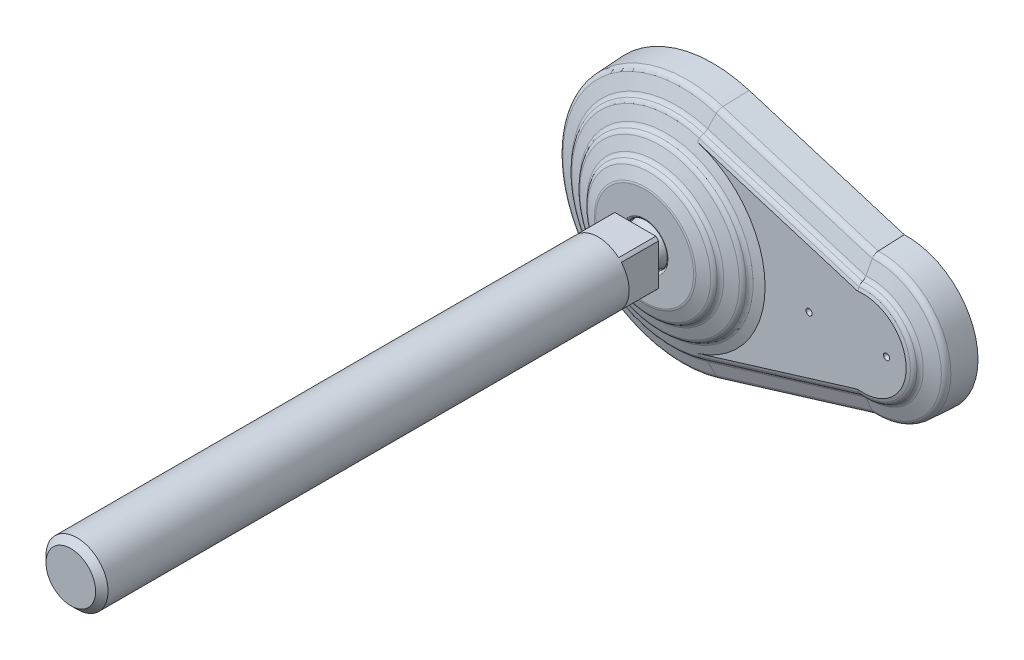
ISO-10303-21;
HEADER;
FILE_DESCRIPTION(('STEP AP214'),'2;1');
FILE_NAME('part.step','',(''),(''),'','','');
FILE_SCHEMA(('AUTOMOTIVE_DESIGN { 1 0 10303 214 1 1 1 1 }'));
ENDSEC;
DATA;
#1=APPLICATION_CONTEXT('core data for automotive mechanical design processes');
#2=APPLICATION_PROTOCOL_DEFINITION('international standard','automotive_design',2000,#1);
#3=PRODUCT_CONTEXT('',#1,'mechanical');
#4=PRODUCT('Part','Part','',(#3));
#5=PRODUCT_RELATED_PRODUCT_CATEGORY('part','',(#4));
#6=PRODUCT_DEFINITION_FORMATION('','',#4);
#7=PRODUCT_DEFINITION_CONTEXT('part definition',#1,'design');
#8=PRODUCT_DEFINITION('design','',#6,#7);
#9=PRODUCT_DEFINITION_SHAPE('','',#8);
#10=(LENGTH_UNIT() NAMED_UNIT(*) SI_UNIT(.MILLI.,.METRE.));
#11=(NAMED_UNIT(*) PLANE_ANGLE_UNIT() SI_UNIT($,.RADIAN.));
#12=(NAMED_UNIT(*) SI_UNIT($,.STERADIAN.) SOLID_ANGLE_UNIT());
#13=UNCERTAINTY_MEASURE_WITH_UNIT(LENGTH_MEASURE(1.E-05),#10,'distance_accuracy_value','');
#14=(GEOMETRIC_REPRESENTATION_CONTEXT(3) GLOBAL_UNCERTAINTY_ASSIGNED_CONTEXT((#13)) GLOBAL_UNIT_ASSIGNED_CONTEXT((#10,
#11,#12)) REPRESENTATION_CONTEXT('',''));
#15=CARTESIAN_POINT('',(0.,0.,0.));
#16=DIRECTION('',(0.,0.,1.));
#17=DIRECTION('',(1.,0.,0.));
#18=AXIS2_PLACEMENT_3D('',#15,#16,#17);
#19=CARTESIAN_POINT('',(0.,0.,39.));
#20=DIRECTION('',(0.,0.,1.));
#21=DIRECTION('',(-1.,0.,0.));
#22=AXIS2_PLACEMENT_3D('',#19,#20,#21);
#23=CYLINDRICAL_SURFACE('',#22,10.);
#24=CARTESIAN_POINT('',(0.,0.,207.));
#25=DIRECTION('',(0.,0.,1.));
#26=DIRECTION('',(-1.,0.,0.));
#27=AXIS2_PLACEMENT_3D('',#24,#25,#26);
#28=CIRCLE('',#27,10.);
#29=CARTESIAN_POINT('',(-10.,0.,207.));
#30=VERTEX_POINT('',#29);
#31=EDGE_CURVE('E9',#30,#30,#28,.F.);
#32=ORIENTED_EDGE('',*,*,#31,.T.);
#33=EDGE_LOOP('',(#32));
#34=FACE_BOUND('',#33,.T.);
#35=DIRECTION('',(0.,0.,1.));
#36=VECTOR('',#35,1.);
#37=CARTESIAN_POINT('',(-6.61437827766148,-7.5,39.));
#38=LINE('',#37,#36);
#39=CARTESIAN_POINT('',(-6.61437827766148,-7.5,39.));
#40=VERTEX_POINT('',#39);
#41=CARTESIAN_POINT('',(-6.61437827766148,-7.5,27.));
#42=VERTEX_POINT('',#41);
#43=EDGE_CURVE('E159',#40,#42,#38,.F.);
#44=ORIENTED_EDGE('',*,*,#43,.F.);
#45=CARTESIAN_POINT('',(0.,0.,39.));
#46=DIRECTION('',(0.,0.,1.));
#47=DIRECTION('',(0.,-1.,0.));
#48=AXIS2_PLACEMENT_3D('',#45,#46,#47);
#49=CIRCLE('',#48,10.);
#50=CARTESIAN_POINT('',(6.61437827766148,-7.5,39.));
#51=VERTEX_POINT('',#50);
#52=EDGE_CURVE('E805',#40,#51,#49,.T.);
#53=ORIENTED_EDGE('',*,*,#52,.T.);
#54=DIRECTION('',(0.,0.,1.));
#55=VECTOR('',#54,1.);
#56=CARTESIAN_POINT('',(6.61437827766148,-7.5,39.));
#57=LINE('',#56,#55);
#58=CARTESIAN_POINT('',(6.61437827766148,-7.5,27.));
#59=VERTEX_POINT('',#58);
#60=EDGE_CURVE('E224',#59,#51,#57,.T.);
#61=ORIENTED_EDGE('',*,*,#60,.F.);
#62=CARTESIAN_POINT('',(0.,0.,27.));
#63=DIRECTION('',(0.,0.,1.));
#64=DIRECTION('',(-1.,0.,0.));
#65=AXIS2_PLACEMENT_3D('',#62,#63,#64);
#66=CIRCLE('',#65,10.);
#67=CARTESIAN_POINT('',(7.5,-6.61437827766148,27.));
#68=VERTEX_POINT('',#67);
#69=EDGE_CURVE('E207',#59,#68,#66,.T.);
#70=ORIENTED_EDGE('',*,*,#69,.T.);
#71=DIRECTION('',(0.,0.,1.));
#72=VECTOR('',#71,1.);
#73=CARTESIAN_POINT('',(7.5,-6.61437827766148,39.));
#74=LINE('',#73,#72);
#75=CARTESIAN_POINT('',(7.5,-6.61437827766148,39.));
#76=VERTEX_POINT('',#75);
#77=EDGE_CURVE('E221',#76,#68,#74,.F.);
#78=ORIENTED_EDGE('',*,*,#77,.F.);
#79=CARTESIAN_POINT('',(7.5,6.61437827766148,39.));
#80=VERTEX_POINT('',#79);
#81=EDGE_CURVE('E301',#76,#80,#49,.T.);
#82=ORIENTED_EDGE('',*,*,#81,.T.);
#83=DIRECTION('',(0.,0.,1.));
#84=VECTOR('',#83,1.);
#85=CARTESIAN_POINT('',(7.5,6.61437827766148,39.));
#86=LINE('',#85,#84);
#87=CARTESIAN_POINT('',(7.5,6.61437827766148,27.));
#88=VERTEX_POINT('',#87);
#89=EDGE_CURVE('E266',#88,#80,#86,.T.);
#90=ORIENTED_EDGE('',*,*,#89,.F.);
#91=CARTESIAN_POINT('',(6.61437827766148,7.5,27.));
#92=VERTEX_POINT('',#91);
#93=EDGE_CURVE('E203',#88,#92,#66,.T.);
#94=ORIENTED_EDGE('',*,*,#93,.T.);
#95=DIRECTION('',(0.,0.,1.));
#96=VECTOR('',#95,1.);
#97=CARTESIAN_POINT('',(6.61437827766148,7.5,39.));
#98=LINE('',#97,#96);
#99=CARTESIAN_POINT('',(6.61437827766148,7.5,39.));
#100=VERTEX_POINT('',#99);
#101=EDGE_CURVE('E184',#100,#92,#98,.F.);
#102=ORIENTED_EDGE('',*,*,#101,.F.);
#103=CARTESIAN_POINT('',(-6.61437827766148,7.5,39.));
#104=VERTEX_POINT('',#103);
#105=EDGE_CURVE('E197',#100,#104,#49,.T.);
#106=ORIENTED_EDGE('',*,*,#105,.T.);
#107=DIRECTION('',(0.,0.,1.));
#108=VECTOR('',#107,1.);
#109=CARTESIAN_POINT('',(-6.61437827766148,7.5,39.));
#110=LINE('',#109,#108);
#111=CARTESIAN_POINT('',(-6.61437827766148,7.5,27.));
#112=VERTEX_POINT('',#111);
#113=EDGE_CURVE('E182',#112,#104,#110,.T.);
#114=ORIENTED_EDGE('',*,*,#113,.F.);
#115=CARTESIAN_POINT('',(-7.5,6.61437827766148,27.));
#116=VERTEX_POINT('',#115);
#117=EDGE_CURVE('E195',#112,#116,#66,.T.);
#118=ORIENTED_EDGE('',*,*,#117,.T.);
#119=DIRECTION('',(0.,0.,1.));
#120=VECTOR('',#119,1.);
#121=CARTESIAN_POINT('',(-7.5,6.61437827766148,39.));
#122=LINE('',#121,#120);
#123=CARTESIAN_POINT('',(-7.5,6.61437827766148,39.));
#124=VERTEX_POINT('',#123);
#125=EDGE_CURVE('E198',#124,#116,#122,.F.);
#126=ORIENTED_EDGE('',*,*,#125,.F.);
#127=CARTESIAN_POINT('',(-7.5,-6.61437827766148,39.));
#128=VERTEX_POINT('',#127);
#129=EDGE_CURVE('E806',#124,#128,#49,.T.);
#130=ORIENTED_EDGE('',*,*,#129,.T.);
#131=DIRECTION('',(0.,0.,1.));
#132=VECTOR('',#131,1.);
#133=CARTESIAN_POINT('',(-7.5,-6.61437827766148,39.));
#134=LINE('',#133,#132);
#135=CARTESIAN_POINT('',(-7.5,-6.61437827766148,27.));
#136=VERTEX_POINT('',#135);
#137=EDGE_CURVE('E204',#136,#128,#134,.T.);
#138=ORIENTED_EDGE('',*,*,#137,.F.);
#139=EDGE_CURVE('E206',#136,#42,#66,.T.);
#140=ORIENTED_EDGE('',*,*,#139,.T.);
#141=EDGE_LOOP('',(#44,#53,#61,#70,#78,#82,#90,#94,#102,#106,#114,#118,#126,#130,#138,#140));
#142=FACE_BOUND('',#141,.T.);
#143=ADVANCED_FACE('F15',(#34,#142),#23,.T.);
#144=CARTESIAN_POINT('',(-5.26544933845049,0.,27.));
#145=DIRECTION('',(0.,0.,1.));
#146=DIRECTION('',(-1.,0.,0.));
#147=AXIS2_PLACEMENT_3D('',#144,#145,#146);
#148=PLANE('',#147);
#149=DIRECTION('',(0.,-1.,0.));
#150=VECTOR('',#149,1.);
#151=CARTESIAN_POINT('',(-7.5,7.5,27.));
#152=LINE('',#151,#150);
#153=EDGE_CURVE('E32',#116,#136,#152,.T.);
#154=ORIENTED_EDGE('',*,*,#153,.F.);
#155=ORIENTED_EDGE('',*,*,#117,.F.);
#156=DIRECTION('',(-1.,0.,0.));
#157=VECTOR('',#156,1.);
#158=CARTESIAN_POINT('',(7.5,7.5,27.));
#159=LINE('',#158,#157);
#160=EDGE_CURVE('E177',#92,#112,#159,.T.);
#161=ORIENTED_EDGE('',*,*,#160,.F.);
#162=ORIENTED_EDGE('',*,*,#93,.F.);
#163=DIRECTION('',(0.,1.,0.));
#164=VECTOR('',#163,1.);
#165=CARTESIAN_POINT('',(7.5,-7.5,27.));
#166=LINE('',#165,#164);
#167=EDGE_CURVE('E189',#68,#88,#166,.T.);
#168=ORIENTED_EDGE('',*,*,#167,.F.);
#169=ORIENTED_EDGE('',*,*,#69,.F.);
#170=DIRECTION('',(1.,0.,0.));
#171=VECTOR('',#170,1.);
#172=CARTESIAN_POINT('',(-7.5,-7.5,27.));
#173=LINE('',#172,#171);
#174=EDGE_CURVE('E226',#42,#59,#173,.T.);
#175=ORIENTED_EDGE('',*,*,#174,.F.);
#176=ORIENTED_EDGE('',*,*,#139,.F.);
#177=EDGE_LOOP('',(#154,#155,#161,#162,#168,#169,#175,#176));
#178=FACE_BOUND('',#177,.T.);
#179=CARTESIAN_POINT('',(0.,0.,27.));
#180=DIRECTION('',(0.,0.,1.));
#181=DIRECTION('',(-1.,0.,0.));
#182=AXIS2_PLACEMENT_3D('',#179,#180,#181);
#183=CIRCLE('',#182,5.26544933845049);
#184=CARTESIAN_POINT('',(-5.26544933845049,0.,27.));
#185=VERTEX_POINT('',#184);
#186=EDGE_CURVE('E212',#185,#185,#183,.T.);
#187=ORIENTED_EDGE('',*,*,#186,.T.);
#188=EDGE_LOOP('',(#187));
#189=FACE_BOUND('',#188,.T.);
#190=ADVANCED_FACE('F200',(#178,#189),#148,.F.);
#191=CARTESIAN_POINT('',(0.,0.,20.6509999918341));
#192=DIRECTION('',(0.,0.,1.));
#193=DIRECTION('',(-1.,0.,0.));
#194=AXIS2_PLACEMENT_3D('',#191,#192,#193);
#195=DEGENERATE_TOROIDAL_SURFACE('',#194,0.000333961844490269,6.829,.T.);
#196=CARTESIAN_POINT('',(0.,0.,21.794));
#197=DIRECTION('',(0.,0.,-1.));
#198=DIRECTION('',(1.,0.,0.));
#199=AXIS2_PLACEMENT_3D('',#196,#197,#198);
#200=CIRCLE('',#199,6.733);
#201=CARTESIAN_POINT('',(6.733,0.,21.794));
#202=VERTEX_POINT('',#201);
#203=EDGE_CURVE('E273',#202,#202,#200,.T.);
#204=ORIENTED_EDGE('',*,*,#203,.F.);
#205=EDGE_LOOP('',(#204));
#206=FACE_BOUND('',#205,.T.);
#207=CARTESIAN_POINT('',(0.,0.,25.));
#208=DIRECTION('',(0.,0.,1.));
#209=DIRECTION('',(-1.,0.,0.));
#210=AXIS2_PLACEMENT_3D('',#207,#208,#209);
#211=CIRCLE('',#210,5.26544933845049);
#212=CARTESIAN_POINT('',(-5.26544933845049,0.,25.));
#213=VERTEX_POINT('',#212);
#214=EDGE_CURVE('E214',#213,#213,#211,.T.);
#215=ORIENTED_EDGE('',*,*,#214,.F.);
#216=EDGE_LOOP('',(#215));
#217=FACE_BOUND('',#216,.T.);
#218=ADVANCED_FACE('F512',(#206,#217),#195,.T.);
#219=CARTESIAN_POINT('',(0.,0.,39.));
#220=DIRECTION('',(0.,0.,1.));
#221=DIRECTION('',(-1.,0.,0.));
#222=AXIS2_PLACEMENT_3D('',#219,#220,#221);
#223=CYLINDRICAL_SURFACE('',#222,5.26544933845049);
#224=ORIENTED_EDGE('',*,*,#186,.F.);
#225=EDGE_LOOP('',(#224));
#226=FACE_BOUND('',#225,.T.);
#227=ORIENTED_EDGE('',*,*,#214,.T.);
#228=EDGE_LOOP('',(#227));
#229=FACE_BOUND('',#228,.T.);
#230=ADVANCED_FACE('F780',(#226,#229),#223,.T.);
#231=CARTESIAN_POINT('',(-7.5,-7.5,27.));
#232=DIRECTION('',(0.,-1.,0.));
#233=DIRECTION('',(1.,0.,0.));
#234=AXIS2_PLACEMENT_3D('',#231,#232,#233);
#235=PLANE('',#234);
#236=ORIENTED_EDGE('',*,*,#60,.T.);
#237=DIRECTION('',(-1.,0.,0.));
#238=VECTOR('',#237,1.);
#239=CARTESIAN_POINT('',(-10.,-7.5,39.));
#240=LINE('',#239,#238);
#241=EDGE_CURVE('E238',#51,#40,#240,.T.);
#242=ORIENTED_EDGE('',*,*,#241,.T.);
#243=ORIENTED_EDGE('',*,*,#43,.T.);
#244=ORIENTED_EDGE('',*,*,#174,.T.);
#245=EDGE_LOOP('',(#236,#242,#243,#244));
#246=FACE_BOUND('',#245,.T.);
#247=ADVANCED_FACE('F778',(#246),#235,.T.);
#248=CARTESIAN_POINT('',(7.5,-7.5,27.));
#249=DIRECTION('',(1.,0.,0.));
#250=DIRECTION('',(0.,1.,0.));
#251=AXIS2_PLACEMENT_3D('',#248,#249,#250);
#252=PLANE('',#251);
#253=ORIENTED_EDGE('',*,*,#89,.T.);
#254=DIRECTION('',(0.,-1.,0.));
#255=VECTOR('',#254,1.);
#256=CARTESIAN_POINT('',(7.5,0.,39.));
#257=LINE('',#256,#255);
#258=EDGE_CURVE('E245',#80,#76,#257,.T.);
#259=ORIENTED_EDGE('',*,*,#258,.T.);
#260=ORIENTED_EDGE('',*,*,#77,.T.);
#261=ORIENTED_EDGE('',*,*,#167,.T.);
#262=EDGE_LOOP('',(#253,#259,#260,#261));
#263=FACE_BOUND('',#262,.T.);
#264=ADVANCED_FACE('F774',(#263),#252,.T.);
#265=CARTESIAN_POINT('',(7.5,7.5,27.));
#266=DIRECTION('',(0.,1.,0.));
#267=DIRECTION('',(-1.,0.,0.));
#268=AXIS2_PLACEMENT_3D('',#265,#266,#267);
#269=PLANE('',#268);
#270=ORIENTED_EDGE('',*,*,#113,.T.);
#271=DIRECTION('',(1.,0.,0.));
#272=VECTOR('',#271,1.);
#273=CARTESIAN_POINT('',(-10.,7.5,39.));
#274=LINE('',#273,#272);
#275=EDGE_CURVE('E249',#104,#100,#274,.T.);
#276=ORIENTED_EDGE('',*,*,#275,.T.);
#277=ORIENTED_EDGE('',*,*,#101,.T.);
#278=ORIENTED_EDGE('',*,*,#160,.T.);
#279=EDGE_LOOP('',(#270,#276,#277,#278));
#280=FACE_BOUND('',#279,.T.);
#281=ADVANCED_FACE('F179',(#280),#269,.T.);
#282=CARTESIAN_POINT('',(-7.5,7.5,27.));
#283=DIRECTION('',(-1.,0.,0.));
#284=DIRECTION('',(0.,-1.,0.));
#285=AXIS2_PLACEMENT_3D('',#282,#283,#284);
#286=PLANE('',#285);
#287=ORIENTED_EDGE('',*,*,#137,.T.);
#288=DIRECTION('',(0.,1.,0.));
#289=VECTOR('',#288,1.);
#290=CARTESIAN_POINT('',(-7.5,0.,39.));
#291=LINE('',#290,#289);
#292=EDGE_CURVE('E262',#128,#124,#291,.T.);
#293=ORIENTED_EDGE('',*,*,#292,.T.);
#294=ORIENTED_EDGE('',*,*,#125,.T.);
#295=ORIENTED_EDGE('',*,*,#153,.T.);
#296=EDGE_LOOP('',(#287,#293,#294,#295));
#297=FACE_BOUND('',#296,.T.);
#298=ADVANCED_FACE('F754',(#297),#286,.T.);
#299=CARTESIAN_POINT('',(0.,0.,0.));
#300=DIRECTION('',(0.,0.,1.));
#301=DIRECTION('',(0.,-1.,0.));
#302=AXIS2_PLACEMENT_3D('',#299,#300,#301);
#303=PLANE('',#302);
#304=DIRECTION('',(-0.951485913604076,0.307692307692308,0.));
#305=VECTOR('',#304,1.);
#306=CARTESIAN_POINT('',(69.9230769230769,15.2237746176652,0.));
#307=LINE('',#306,#305);
#308=CARTESIAN_POINT('',(69.9230769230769,15.2237746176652,0.));
#309=VERTEX_POINT('',#308);
#310=CARTESIAN_POINT('',(11.0769230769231,34.2534928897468,0.));
#311=VERTEX_POINT('',#310);
#312=EDGE_CURVE('E285',#309,#311,#307,.T.);
#313=ORIENTED_EDGE('',*,*,#312,.F.);
#314=CARTESIAN_POINT('',(65.,0.,0.));
#315=DIRECTION('',(0.,0.,1.));
#316=DIRECTION('',(1.,0.,0.));
#317=AXIS2_PLACEMENT_3D('',#314,#315,#316);
#318=CIRCLE('',#317,16.);
#319=CARTESIAN_POINT('',(69.9230769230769,-15.2237746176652,0.));
#320=VERTEX_POINT('',#319);
#321=EDGE_CURVE('E295',#320,#309,#318,.T.);
#322=ORIENTED_EDGE('',*,*,#321,.F.);
#323=DIRECTION('',(0.951485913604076,0.307692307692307,0.));
#324=VECTOR('',#323,1.);
#325=CARTESIAN_POINT('',(11.0769230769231,-34.2534928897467,0.));
#326=LINE('',#325,#324);
#327=CARTESIAN_POINT('',(11.0769230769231,-34.2534928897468,0.));
#328=VERTEX_POINT('',#327);
#329=EDGE_CURVE('E292',#328,#320,#326,.T.);
#330=ORIENTED_EDGE('',*,*,#329,.F.);
#331=CARTESIAN_POINT('',(0.,0.,0.));
#332=DIRECTION('',(0.,0.,1.));
#333=DIRECTION('',(1.,0.,0.));
#334=AXIS2_PLACEMENT_3D('',#331,#332,#333);
#335=CIRCLE('',#334,36.);
#336=EDGE_CURVE('E288',#311,#328,#335,.T.);
#337=ORIENTED_EDGE('',*,*,#336,.F.);
#338=EDGE_LOOP('',(#313,#322,#330,#337));
#339=FACE_BOUND('',#338,.T.);
#340=ADVANCED_FACE('F514',(#339),#303,.F.);
#341=CARTESIAN_POINT('',(11.0769230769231,-34.2534928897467,0.));
#342=DIRECTION('',(0.307692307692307,-0.951485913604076,0.));
#343=DIRECTION('',(0.951485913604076,0.307692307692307,0.));
#344=AXIS2_PLACEMENT_3D('',#341,#342,#343);
#345=PLANE('',#344);
#346=DIRECTION('',(0.951485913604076,0.307692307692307,0.));
#347=VECTOR('',#346,1.);
#348=CARTESIAN_POINT('',(11.0769230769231,-34.2534928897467,2.));
#349=LINE('',#348,#347);
#350=CARTESIAN_POINT('',(11.0769230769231,-34.2534928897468,2.));
#351=VERTEX_POINT('',#350);
#352=CARTESIAN_POINT('',(69.9230769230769,-15.2237746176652,2.));
#353=VERTEX_POINT('',#352);
#354=EDGE_CURVE('E304',#351,#353,#349,.T.);
#355=ORIENTED_EDGE('',*,*,#354,.F.);
#356=DIRECTION('',(0.,0.,1.));
#357=VECTOR('',#356,1.);
#358=CARTESIAN_POINT('',(11.0769230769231,-34.2534928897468,0.));
#359=LINE('',#358,#357);
#360=EDGE_CURVE('E312',#328,#351,#359,.T.);
#361=ORIENTED_EDGE('',*,*,#360,.F.);
#362=ORIENTED_EDGE('',*,*,#329,.T.);
#363=DIRECTION('',(0.,0.,1.));
#364=VECTOR('',#363,1.);
#365=CARTESIAN_POINT('',(69.9230769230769,-15.2237746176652,0.));
#366=LINE('',#365,#364);
#367=EDGE_CURVE('E310',#320,#353,#366,.T.);
#368=ORIENTED_EDGE('',*,*,#367,.T.);
#369=EDGE_LOOP('',(#355,#361,#362,#368));
#370=FACE_BOUND('',#369,.T.);
#371=ADVANCED_FACE('F771',(#370),#345,.T.);
#372=CARTESIAN_POINT('',(0.,0.,0.));
#373=DIRECTION('',(0.,0.,1.));
#374=DIRECTION('',(0.,-1.,0.));
#375=AXIS2_PLACEMENT_3D('',#372,#373,#374);
#376=CYLINDRICAL_SURFACE('',#375,36.);
#377=CARTESIAN_POINT('',(0.,0.,2.));
#378=DIRECTION('',(0.,0.,1.));
#379=DIRECTION('',(1.,0.,0.));
#380=AXIS2_PLACEMENT_3D('',#377,#378,#379);
#381=CIRCLE('',#380,36.);
#382=CARTESIAN_POINT('',(11.0769230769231,34.2534928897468,2.));
#383=VERTEX_POINT('',#382);
#384=EDGE_CURVE('E300',#383,#351,#381,.T.);
#385=ORIENTED_EDGE('',*,*,#384,.F.);
#386=DIRECTION('',(0.,0.,1.));
#387=VECTOR('',#386,1.);
#388=CARTESIAN_POINT('',(11.0769230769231,34.2534928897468,0.));
#389=LINE('',#388,#387);
#390=EDGE_CURVE('E314',#311,#383,#389,.T.);
#391=ORIENTED_EDGE('',*,*,#390,.F.);
#392=ORIENTED_EDGE('',*,*,#336,.T.);
#393=ORIENTED_EDGE('',*,*,#360,.T.);
#394=EDGE_LOOP('',(#385,#391,#392,#393));
#395=FACE_BOUND('',#394,.T.);
#396=ADVANCED_FACE('F1138',(#395),#376,.T.);
#397=CARTESIAN_POINT('',(69.9230769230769,15.2237746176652,0.));
#398=DIRECTION('',(0.307692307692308,0.951485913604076,0.));
#399=DIRECTION('',(-0.951485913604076,0.307692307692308,0.));
#400=AXIS2_PLACEMENT_3D('',#397,#398,#399);
#401=PLANE('',#400);
#402=DIRECTION('',(-0.951485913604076,0.307692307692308,0.));
#403=VECTOR('',#402,1.);
#404=CARTESIAN_POINT('',(69.9230769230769,15.2237746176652,2.));
#405=LINE('',#404,#403);
#406=CARTESIAN_POINT('',(69.9230769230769,15.2237746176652,2.));
#407=VERTEX_POINT('',#406);
#408=EDGE_CURVE('E150',#407,#383,#405,.T.);
#409=ORIENTED_EDGE('',*,*,#408,.F.);
#410=DIRECTION('',(0.,0.,1.));
#411=VECTOR('',#410,1.);
#412=CARTESIAN_POINT('',(69.9230769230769,15.2237746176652,0.));
#413=LINE('',#412,#411);
#414=EDGE_CURVE('E298',#309,#407,#413,.T.);
#415=ORIENTED_EDGE('',*,*,#414,.F.);
#416=ORIENTED_EDGE('',*,*,#312,.T.);
#417=ORIENTED_EDGE('',*,*,#390,.T.);
#418=EDGE_LOOP('',(#409,#415,#416,#417));
#419=FACE_BOUND('',#418,.T.);
#420=ADVANCED_FACE('F538',(#419),#401,.T.);
#421=CARTESIAN_POINT('',(65.,0.,0.));
#422=DIRECTION('',(0.,0.,1.));
#423=DIRECTION('',(0.,-1.,0.));
#424=AXIS2_PLACEMENT_3D('',#421,#422,#423);
#425=CYLINDRICAL_SURFACE('',#424,16.);
#426=CARTESIAN_POINT('',(65.,0.,2.));
#427=DIRECTION('',(0.,0.,1.));
#428=DIRECTION('',(1.,0.,0.));
#429=AXIS2_PLACEMENT_3D('',#426,#427,#428);
#430=CIRCLE('',#429,16.);
#431=EDGE_CURVE('E289',#353,#407,#430,.T.);
#432=ORIENTED_EDGE('',*,*,#431,.F.);
#433=ORIENTED_EDGE('',*,*,#367,.F.);
#434=ORIENTED_EDGE('',*,*,#321,.T.);
#435=ORIENTED_EDGE('',*,*,#414,.T.);
#436=EDGE_LOOP('',(#432,#433,#434,#435));
#437=FACE_BOUND('',#436,.T.);
#438=ADVANCED_FACE('F523',(#437),#425,.T.);
#439=CARTESIAN_POINT('',(62.5,0.,2.));
#440=DIRECTION('',(0.,0.,-1.));
#441=DIRECTION('',(0.,1.,0.));
#442=AXIS2_PLACEMENT_3D('',#439,#440,#441);
#443=CONICAL_SURFACE('',#442,22.9787234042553,0.0523365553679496);
#444=CARTESIAN_POINT('',(62.5,0.,10.3041173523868));
#445=DIRECTION('',(0.,0.,1.));
#446=DIRECTION('',(0.,-1.,0.));
#447=AXIS2_PLACEMENT_3D('',#444,#445,#446);
#448=CIRCLE('',#447,22.5437172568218);
#449=CARTESIAN_POINT('',(61.6407011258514,-22.5273343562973,10.3041173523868));
#450=VERTEX_POINT('',#449);
#451=CARTESIAN_POINT('',(61.6407011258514,22.5273343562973,10.3041173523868));
#452=VERTEX_POINT('',#451);
#453=EDGE_CURVE('E344',#450,#452,#448,.T.);
#454=ORIENTED_EDGE('',*,*,#453,.F.);
#455=CARTESIAN_POINT('',(61.6406997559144,-22.5273238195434,10.3043173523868));
#456=CARTESIAN_POINT('',(61.6501805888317,-22.600242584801,8.92023165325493));
#457=CARTESIAN_POINT('',(61.6596900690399,-22.6731526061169,7.53614569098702));
#458=CARTESIAN_POINT('',(61.6787663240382,-22.8189551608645,4.76797324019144));
#459=CARTESIAN_POINT('',(61.6883330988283,-22.8918476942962,3.38388675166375));
#460=CARTESIAN_POINT('',(61.6979285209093,-22.9647314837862,1.9998));
#461=B_SPLINE_CURVE_WITH_KNOTS('',3,(#455,#456,#457,#458,#459,#460),.UNSPECIFIED.,.F.,.F.,(4,2,
4),(0.,4.15811282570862,8.31622565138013),.UNSPECIFIED.);
#462=CARTESIAN_POINT('',(61.697927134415,-22.9647209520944,2.));
#463=VERTEX_POINT('',#462);
#464=EDGE_CURVE('E651',#450,#463,#461,.T.);
#465=ORIENTED_EDGE('',*,*,#464,.T.);
#466=CARTESIAN_POINT('',(62.5,0.,2.));
#467=DIRECTION('',(0.,0.,1.));
#468=DIRECTION('',(0.,-1.,0.));
#469=AXIS2_PLACEMENT_3D('',#466,#467,#468);
#470=CIRCLE('',#469,22.9787234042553);
#471=CARTESIAN_POINT('',(61.6979271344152,22.9647209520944,2.));
#472=VERTEX_POINT('',#471);
#473=EDGE_CURVE('E346',#463,#472,#470,.T.);
#474=ORIENTED_EDGE('',*,*,#473,.T.);
#475=CARTESIAN_POINT('',(61.6979285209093,22.9647314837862,1.9998));
#476=CARTESIAN_POINT('',(61.6883330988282,22.8918476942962,3.38388675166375));
#477=CARTESIAN_POINT('',(61.6787663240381,22.8189551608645,4.76797324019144));
#478=CARTESIAN_POINT('',(61.6596900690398,22.6731526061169,7.53614569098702));
#479=CARTESIAN_POINT('',(61.6501805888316,22.600242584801,8.92023165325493));
#480=CARTESIAN_POINT('',(61.6406997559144,22.5273238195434,10.3043173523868));
#481=B_SPLINE_CURVE_WITH_KNOTS('',3,(#475,#476,#477,#478,#479,#480),.UNSPECIFIED.,.F.,.F.,(4,2,
4),(0.,4.15811282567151,8.31622565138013),.UNSPECIFIED.);
#482=EDGE_CURVE('E697',#472,#452,#481,.T.);
#483=ORIENTED_EDGE('',*,*,#482,.T.);
#484=EDGE_LOOP('',(#454,#465,#474,#483));
#485=FACE_BOUND('',#484,.T.);
#486=ADVANCED_FACE('F517',(#485),#443,.T.);
#487=CARTESIAN_POINT('',(64.1644462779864,-21.755748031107,10.3041173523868));
#488=DIRECTION('',(-0.291971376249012,0.9549953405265,-0.0523126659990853));
#489=DIRECTION('',(-0.956304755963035,-0.292371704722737,0.));
#490=AXIS2_PLACEMENT_3D('',#487,#488,#489);
#491=PLANE('',#490);
#492=ORIENTED_EDGE('',*,*,#464,.F.);
#493=DIRECTION('',(-0.956304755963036,-0.292371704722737,0.));
#494=VECTOR('',#493,1.);
#495=CARTESIAN_POINT('',(64.1644462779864,-21.755748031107,10.3041173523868));
#496=LINE('',#495,#494);
#497=CARTESIAN_POINT('',(11.5676847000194,-37.8361917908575,10.3041173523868));
#498=VERTEX_POINT('',#497);
#499=EDGE_CURVE('E600',#450,#498,#496,.T.);
#500=ORIENTED_EDGE('',*,*,#499,.T.);
#501=DIRECTION('',(-0.0152947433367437,0.050026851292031,0.998630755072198));
#502=VECTOR('',#501,1.);
#503=CARTESIAN_POINT('',(11.6948681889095,-38.2521902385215,2.));
#504=LINE('',#503,#502);
#505=CARTESIAN_POINT('',(11.6948681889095,-38.2521902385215,2.));
#506=VERTEX_POINT('',#505);
#507=EDGE_CURVE('E606',#506,#498,#504,.T.);
#508=ORIENTED_EDGE('',*,*,#507,.F.);
#509=DIRECTION('',(-0.956304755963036,-0.292371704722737,0.));
#510=VECTOR('',#509,1.);
#511=CARTESIAN_POINT('',(64.2916297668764,-22.1717464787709,2.));
#512=LINE('',#511,#510);
#513=EDGE_CURVE('E144',#463,#506,#512,.T.);
#514=ORIENTED_EDGE('',*,*,#513,.F.);
#515=EDGE_LOOP('',(#492,#500,#508,#514));
#516=FACE_BOUND('',#515,.T.);
#517=ADVANCED_FACE('F508',(#516),#491,.F.);
#518=CARTESIAN_POINT('',(0.,0.,2.));
#519=DIRECTION('',(0.,0.,1.));
#520=DIRECTION('',(-1.,0.,0.));
#521=AXIS2_PLACEMENT_3D('',#518,#519,#520);
#522=PLANE('',#521);
#523=DIRECTION('',(-0.956304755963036,0.292371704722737,0.));
#524=VECTOR('',#523,1.);
#525=CARTESIAN_POINT('',(64.2916297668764,22.1717464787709,2.));
#526=LINE('',#525,#524);
#527=CARTESIAN_POINT('',(11.6948681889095,38.2521902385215,2.));
#528=VERTEX_POINT('',#527);
#529=EDGE_CURVE('E653',#472,#528,#526,.T.);
#530=ORIENTED_EDGE('',*,*,#529,.F.);
#531=ORIENTED_EDGE('',*,*,#473,.F.);
#532=ORIENTED_EDGE('',*,*,#513,.T.);
#533=CARTESIAN_POINT('',(0.,0.,2.));
#534=DIRECTION('',(0.,0.,1.));
#535=DIRECTION('',(-1.,0.,0.));
#536=AXIS2_PLACEMENT_3D('',#533,#534,#535);
#537=CIRCLE('',#536,40.);
#538=EDGE_CURVE('E389',#528,#506,#537,.T.);
#539=ORIENTED_EDGE('',*,*,#538,.F.);
#540=EDGE_LOOP('',(#530,#531,#532,#539));
#541=FACE_BOUND('',#540,.T.);
#542=ORIENTED_EDGE('',*,*,#431,.T.);
#543=ORIENTED_EDGE('',*,*,#408,.T.);
#544=ORIENTED_EDGE('',*,*,#384,.T.);
#545=ORIENTED_EDGE('',*,*,#354,.T.);
#546=EDGE_LOOP('',(#542,#543,#544,#545));
#547=FACE_BOUND('',#546,.T.);
#548=ADVANCED_FACE('F398',(#541,#547),#522,.F.);
#549=CARTESIAN_POINT('',(64.2916297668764,22.1717464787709,2.));
#550=DIRECTION('',(-0.291971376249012,-0.9549953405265,-0.0523126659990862));
#551=DIRECTION('',(0.956304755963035,-0.292371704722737,0.));
#552=AXIS2_PLACEMENT_3D('',#549,#550,#551);
#553=PLANE('',#552);
#554=ORIENTED_EDGE('',*,*,#482,.F.);
#555=ORIENTED_EDGE('',*,*,#529,.T.);
#556=DIRECTION('',(-0.0152947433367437,-0.050026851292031,0.998630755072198));
#557=VECTOR('',#556,1.);
#558=CARTESIAN_POINT('',(11.6948681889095,38.2521902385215,2.));
#559=LINE('',#558,#557);
#560=CARTESIAN_POINT('',(11.5676847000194,37.8361917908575,10.3041173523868));
#561=VERTEX_POINT('',#560);
#562=EDGE_CURVE('E620',#528,#561,#559,.T.);
#563=ORIENTED_EDGE('',*,*,#562,.T.);
#564=DIRECTION('',(-0.956304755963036,0.292371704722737,0.));
#565=VECTOR('',#564,1.);
#566=CARTESIAN_POINT('',(64.1644462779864,21.755748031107,10.3041173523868));
#567=LINE('',#566,#565);
#568=EDGE_CURVE('E654',#452,#561,#567,.T.);
#569=ORIENTED_EDGE('',*,*,#568,.F.);
#570=EDGE_LOOP('',(#554,#555,#563,#569));
#571=FACE_BOUND('',#570,.T.);
#572=ADVANCED_FACE('F478',(#571),#553,.F.);
#573=CARTESIAN_POINT('',(62.5,0.,10.1991258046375));
#574=DIRECTION('',(0.,0.,1.));
#575=DIRECTION('',(0.,-1.,0.));
#576=AXIS2_PLACEMENT_3D('',#573,#574,#575);
#577=TOROIDAL_SURFACE('',#576,20.5394653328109,2.007);
#578=CARTESIAN_POINT('',(61.6407233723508,-22.5275054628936,10.0974340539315));
#579=CARTESIAN_POINT('',(61.6409510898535,-22.5292569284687,10.1317993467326));
#580=CARTESIAN_POINT('',(61.6410635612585,-22.5301219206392,10.1661964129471));
#581=CARTESIAN_POINT('',(61.6410572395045,-22.5300732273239,10.235045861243));
#582=CARTESIAN_POINT('',(61.6409380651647,-22.5291566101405,10.2694982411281));
#583=CARTESIAN_POINT('',(61.6399396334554,-22.5214778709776,10.4153785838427));
#584=CARTESIAN_POINT('',(61.6379561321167,-22.5062239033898,10.526490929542));
#585=CARTESIAN_POINT('',(61.6316126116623,-22.4573679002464,10.7446232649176));
#586=CARTESIAN_POINT('',(61.6272490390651,-22.4237384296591,10.8516368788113));
#587=CARTESIAN_POINT('',(61.6163034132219,-22.339189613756,11.058357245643));
#588=CARTESIAN_POINT('',(61.6097238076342,-22.2882893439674,11.1580719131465));
#589=CARTESIAN_POINT('',(61.5945702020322,-22.1707054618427,11.3475467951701));
#590=CARTESIAN_POINT('',(61.5859960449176,-22.1040206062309,11.4373062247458));
#591=CARTESIAN_POINT('',(61.5670698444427,-21.9562760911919,11.6050783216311));
#592=CARTESIAN_POINT('',(61.5567047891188,-21.8751110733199,11.6829965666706));
#593=CARTESIAN_POINT('',(61.5345911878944,-21.7011851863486,11.8241014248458));
#594=CARTESIAN_POINT('',(61.5228449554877,-21.6084436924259,11.8873121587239));
#595=CARTESIAN_POINT('',(61.5046129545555,-21.4637836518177,11.9692866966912));
#596=CARTESIAN_POINT('',(61.4985079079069,-21.4152343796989,11.9942523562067));
#597=CARTESIAN_POINT('',(61.4860940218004,-21.3162718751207,12.0401972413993));
#598=CARTESIAN_POINT('',(61.4797850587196,-21.2658575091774,12.0611739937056));
#599=CARTESIAN_POINT('',(61.4596293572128,-21.1043762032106,12.1208327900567));
#600=CARTESIAN_POINT('',(61.4454888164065,-20.9904779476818,12.1519983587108));
#601=CARTESIAN_POINT('',(61.4169436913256,-20.7591475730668,12.1941665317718));
#602=CARTESIAN_POINT('',(61.4025394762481,-20.6417202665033,12.2051954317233));
#603=CARTESIAN_POINT('',(61.3876252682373,-20.5193667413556,12.2061070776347));
#604=CARTESIAN_POINT('',(61.3870090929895,-20.5143103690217,12.2061258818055));
#605=CARTESIAN_POINT('',(61.3863931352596,-20.5092543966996,12.2061258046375));
#606=B_SPLINE_CURVE_WITH_KNOTS('',3,(#578,#579,#580,#581,#582,#583,#584,#585,#586,#587,#588,
#589,#590,#591,#592,#593,#594,#595,#596,#597,#598,#599,#600,#601,#602,#603,#604,#605),
.UNSPECIFIED.,.F.,.F.,(4,2,2,2,2,2,2,2,2,2,2,2,2,4),(0.,0.103191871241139,0.20655369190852,
0.541275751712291,0.87649892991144,1.21135305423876,1.54623356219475,1.8836582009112,
2.22052549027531,2.38517216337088,2.54992059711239,2.9048600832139,3.25933573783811,
3.2746170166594),.UNSPECIFIED.);
#607=CARTESIAN_POINT('',(61.4734629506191,-21.2152067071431,12.0798866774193));
#608=VERTEX_POINT('',#607);
#609=EDGE_CURVE('E1245',#450,#608,#606,.T.);
#610=ORIENTED_EDGE('',*,*,#609,.F.);
#611=ORIENTED_EDGE('',*,*,#453,.T.);
#612=CARTESIAN_POINT('',(61.3863931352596,20.5092543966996,12.2061258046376));
#613=CARTESIAN_POINT('',(61.3870091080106,20.5143104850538,12.2061258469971));
#614=CARTESIAN_POINT('',(61.3876252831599,20.5193668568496,12.206107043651));
#615=CARTESIAN_POINT('',(61.3988855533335,20.6117442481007,12.2054193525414));
#616=CARTESIAN_POINT('',(61.4095840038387,20.6991031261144,12.1991511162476));
#617=CARTESIAN_POINT('',(61.4308936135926,20.8723273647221,12.1754412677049));
#618=CARTESIAN_POINT('',(61.4415047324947,20.9581920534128,12.1579947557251));
#619=CARTESIAN_POINT('',(61.4555813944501,21.0716202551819,12.1272225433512));
#620=CARTESIAN_POINT('',(61.4591730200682,21.1005182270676,12.1186877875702));
#621=CARTESIAN_POINT('',(61.4663157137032,21.1579059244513,12.1003430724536));
#622=CARTESIAN_POINT('',(61.4698667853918,21.1863956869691,12.090533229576));
#623=CARTESIAN_POINT('',(61.4866782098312,21.3210820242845,12.0407628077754));
#624=CARTESIAN_POINT('',(61.4996430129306,21.4243838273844,11.9924168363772));
#625=CARTESIAN_POINT('',(61.5245148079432,21.6216549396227,11.8789198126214));
#626=CARTESIAN_POINT('',(61.5364193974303,21.7156031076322,11.8137318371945));
#627=CARTESIAN_POINT('',(61.5587594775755,21.8912250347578,11.6683429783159));
#628=CARTESIAN_POINT('',(61.5691956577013,21.9729045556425,11.5881491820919));
#629=CARTESIAN_POINT('',(61.5882470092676,22.1215501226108,11.4149543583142));
#630=CARTESIAN_POINT('',(61.5968625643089,22.1885192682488,11.3219560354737));
#631=CARTESIAN_POINT('',(61.6119005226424,22.3051440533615,11.1267480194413));
#632=CARTESIAN_POINT('',(61.6183432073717,22.3549598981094,11.0246354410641));
#633=CARTESIAN_POINT('',(61.6289130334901,22.4365717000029,10.8134345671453));
#634=CARTESIAN_POINT('',(61.6330436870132,22.4683949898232,10.704357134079));
#635=CARTESIAN_POINT('',(61.6371976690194,22.5003783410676,10.5457196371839));
#636=CARTESIAN_POINT('',(61.6382205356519,22.5082502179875,10.4976293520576));
#637=CARTESIAN_POINT('',(61.639806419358,22.5204527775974,10.4010313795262));
#638=CARTESIAN_POINT('',(61.6403698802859,22.52478687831,10.3525241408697));
#639=CARTESIAN_POINT('',(61.6411729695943,22.5309631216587,10.2351641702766));
#640=CARTESIAN_POINT('',(61.641181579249,22.5310278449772,10.1662118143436));
#641=CARTESIAN_POINT('',(61.6407233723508,22.5275054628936,10.0974340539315));
#642=B_SPLINE_CURVE_WITH_KNOTS('',3,(#612,#613,#614,#615,#616,#617,#618,#619,#620,#621,#622,
#623,#624,#625,#626,#627,#628,#629,#630,#631,#632,#633,#634,#635,#636,#637,#638,#639,#640,#641),
.UNSPECIFIED.,.F.,.F.,(4,2,2,2,2,2,2,2,2,2,2,2,2,2,4),(0.,0.0152812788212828,0.279174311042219,
0.543183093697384,0.634194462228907,0.725197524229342,1.06775959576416,1.41107914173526,
1.75423694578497,2.09732237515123,2.43711059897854,2.77638125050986,2.92250118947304,
3.06847978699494,3.27496314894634),.UNSPECIFIED.);
#643=CARTESIAN_POINT('',(61.4734629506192,21.2152067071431,12.0798866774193));
#644=VERTEX_POINT('',#643);
#645=EDGE_CURVE('E467',#644,#452,#642,.T.);
#646=ORIENTED_EDGE('',*,*,#645,.F.);
#647=CARTESIAN_POINT('',(62.5,0.,12.0798866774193));
#648=DIRECTION('',(0.,0.,1.));
#649=DIRECTION('',(0.,-1.,0.));
#650=AXIS2_PLACEMENT_3D('',#647,#648,#649);
#651=CIRCLE('',#650,21.2400276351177);
#652=EDGE_CURVE('E342',#608,#644,#651,.T.);
#653=ORIENTED_EDGE('',*,*,#652,.F.);
#654=EDGE_LOOP('',(#610,#611,#646,#653));
#655=FACE_BOUND('',#654,.T.);
#656=ADVANCED_FACE('F449',(#655),#577,.T.);
#657=CARTESIAN_POINT('',(63.5784597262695,-19.8390723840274,10.1991258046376));
#658=DIRECTION('',(-0.956304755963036,-0.292371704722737,0.));
#659=DIRECTION('',(0.292371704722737,-0.956304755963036,0.));
#660=AXIS2_PLACEMENT_3D('',#657,#658,#659);
#661=CYLINDRICAL_SURFACE('',#660,2.00699999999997);
#662=ORIENTED_EDGE('',*,*,#499,.F.);
#663=ORIENTED_EDGE('',*,*,#609,.T.);
#664=DIRECTION('',(-0.956304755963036,-0.292371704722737,0.));
#665=VECTOR('',#664,1.);
#666=CARTESIAN_POINT('',(63.7832843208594,-20.5090234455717,12.0798866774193));
#667=LINE('',#666,#665);
#668=CARTESIAN_POINT('',(11.1865227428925,-36.5894672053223,12.0798866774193));
#669=VERTEX_POINT('',#668);
#670=EDGE_CURVE('E597',#608,#669,#667,.T.);
#671=ORIENTED_EDGE('',*,*,#670,.T.);
#672=CARTESIAN_POINT('',(10.9816981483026,-35.9195161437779,10.1991258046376));
#673=DIRECTION('',(0.956304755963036,0.292371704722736,0.));
#674=DIRECTION('',(-0.292371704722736,0.956304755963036,0.));
#675=AXIS2_PLACEMENT_3D('',#672,#673,#674);
#676=CIRCLE('',#675,2.007);
#677=EDGE_CURVE('E609',#669,#498,#676,.T.);
#678=ORIENTED_EDGE('',*,*,#677,.T.);
#679=EDGE_LOOP('',(#662,#663,#671,#678));
#680=FACE_BOUND('',#679,.T.);
#681=ADVANCED_FACE('F479',(#680),#661,.T.);
#682=CARTESIAN_POINT('',(0.,0.,2.));
#683=DIRECTION('',(0.,0.,-1.));
#684=DIRECTION('',(1.,0.,0.));
#685=AXIS2_PLACEMENT_3D('',#682,#683,#684);
#686=CONICAL_SURFACE('',#685,40.,0.0523365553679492);
#687=CARTESIAN_POINT('',(0.,0.,10.3041173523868));
#688=DIRECTION('',(0.,0.,1.));
#689=DIRECTION('',(-1.,0.,0.));
#690=AXIS2_PLACEMENT_3D('',#687,#688,#689);
#691=CIRCLE('',#690,39.5649938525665);
#692=EDGE_CURVE('E640',#561,#498,#691,.T.);
#693=ORIENTED_EDGE('',*,*,#692,.F.);
#694=ORIENTED_EDGE('',*,*,#562,.F.);
#695=ORIENTED_EDGE('',*,*,#538,.T.);
#696=ORIENTED_EDGE('',*,*,#507,.T.);
#697=EDGE_LOOP('',(#693,#694,#695,#696));
#698=FACE_BOUND('',#697,.T.);
#699=ADVANCED_FACE('F499',(#698),#686,.T.);
#700=CARTESIAN_POINT('',(63.5784597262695,19.8390723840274,10.1991258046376));
#701=DIRECTION('',(-0.956304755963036,0.292371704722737,0.));
#702=DIRECTION('',(-0.292371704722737,-0.956304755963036,0.));
#703=AXIS2_PLACEMENT_3D('',#700,#701,#702);
#704=CYLINDRICAL_SURFACE('',#703,2.00699999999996);
#705=DIRECTION('',(-0.956304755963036,0.292371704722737,0.));
#706=VECTOR('',#705,1.);
#707=CARTESIAN_POINT('',(63.7832843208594,20.5090234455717,12.0798866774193));
#708=LINE('',#707,#706);
#709=CARTESIAN_POINT('',(11.1865227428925,36.5894672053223,12.0798866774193));
#710=VERTEX_POINT('',#709);
#711=EDGE_CURVE('E586',#644,#710,#708,.T.);
#712=ORIENTED_EDGE('',*,*,#711,.F.);
#713=ORIENTED_EDGE('',*,*,#645,.T.);
#714=ORIENTED_EDGE('',*,*,#568,.T.);
#715=CARTESIAN_POINT('',(10.9816981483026,35.9195161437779,10.1991258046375));
#716=DIRECTION('',(-0.956304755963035,0.292371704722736,0.));
#717=DIRECTION('',(-0.292371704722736,-0.956304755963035,0.));
#718=AXIS2_PLACEMENT_3D('',#715,#716,#717);
#719=CIRCLE('',#718,2.007);
#720=EDGE_CURVE('E623',#710,#561,#719,.T.);
#721=ORIENTED_EDGE('',*,*,#720,.F.);
#722=EDGE_LOOP('',(#712,#713,#714,#721));
#723=FACE_BOUND('',#722,.T.);
#724=ADVANCED_FACE('F407',(#723),#704,.T.);
#725=CARTESIAN_POINT('',(62.5,0.,12.0798866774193));
#726=DIRECTION('',(0.,0.,-1.));
#727=DIRECTION('',(0.,1.,0.));
#728=AXIS2_PLACEMENT_3D('',#725,#726,#727);
#729=CONICAL_SURFACE('',#728,21.2400276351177,1.21422909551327);
#730=CARTESIAN_POINT('',(62.5,0.,13.656251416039));
#731=DIRECTION('',(0.,0.,1.));
#732=DIRECTION('',(0.,-1.,0.));
#733=AXIS2_PLACEMENT_3D('',#730,#731,#732);
#734=CIRCLE('',#733,17.0080484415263);
#735=CARTESIAN_POINT('',(60.9818619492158,-16.9401584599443,13.656251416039));
#736=VERTEX_POINT('',#735);
#737=CARTESIAN_POINT('',(60.9818619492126,16.9401584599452,13.656251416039));
#738=VERTEX_POINT('',#737);
#739=EDGE_CURVE('E340',#736,#738,#734,.T.);
#740=ORIENTED_EDGE('',*,*,#739,.F.);
#741=CARTESIAN_POINT('',(60.9818053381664,-16.9396143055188,13.656451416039));
#742=CARTESIAN_POINT('',(61.0189355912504,-17.2964789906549,13.5252879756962));
#743=CARTESIAN_POINT('',(61.0571375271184,-17.653206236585,13.3940567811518));
#744=CARTESIAN_POINT('',(61.1355151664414,-18.3663907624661,13.1314756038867));
#745=CARTESIAN_POINT('',(61.1756908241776,-18.7228480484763,13.0001256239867));
#746=CARTESIAN_POINT('',(61.2578477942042,-19.435511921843,12.7373183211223));
#747=CARTESIAN_POINT('',(61.2998290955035,-19.7917185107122,12.6058609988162));
#748=CARTESIAN_POINT('',(61.3854616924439,-20.5039033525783,12.3428458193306));
#749=CARTESIAN_POINT('',(61.4291130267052,-20.8598816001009,12.2112879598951));
#750=CARTESIAN_POINT('',(61.4735304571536,-21.2157475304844,12.0796866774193));
#751=B_SPLINE_CURVE_WITH_KNOTS('',3,(#741,#742,#743,#744,#745,#746,#747,#748,#749,#750),
.UNSPECIFIED.,.F.,.F.,(4,2,2,2,4),(0.,1.14603990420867,2.29205327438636,3.43805966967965,
4.58409258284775),.UNSPECIFIED.);
#752=EDGE_CURVE('E459',#736,#608,#751,.T.);
#753=ORIENTED_EDGE('',*,*,#752,.T.);
#754=ORIENTED_EDGE('',*,*,#652,.T.);
#755=CARTESIAN_POINT('',(61.4735304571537,21.2157475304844,12.0796866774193));
#756=CARTESIAN_POINT('',(61.4291130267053,20.8598816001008,12.2112879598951));
#757=CARTESIAN_POINT('',(61.3854616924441,20.5039033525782,12.3428458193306));
#758=CARTESIAN_POINT('',(61.2998290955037,19.7917185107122,12.6058609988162));
#759=CARTESIAN_POINT('',(61.2578477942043,19.435511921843,12.7373183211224));
#760=CARTESIAN_POINT('',(61.1756908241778,18.7228480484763,13.0001256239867));
#761=CARTESIAN_POINT('',(61.1355151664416,18.3663907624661,13.1314756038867));
#762=CARTESIAN_POINT('',(61.0571375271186,17.653206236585,13.3940567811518));
#763=CARTESIAN_POINT('',(61.0189355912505,17.2964789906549,13.5252879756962));
#764=CARTESIAN_POINT('',(60.9818053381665,16.9396143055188,13.656451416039));
#765=B_SPLINE_CURVE_WITH_KNOTS('',3,(#755,#756,#757,#758,#759,#760,#761,#762,#763,#764),
.UNSPECIFIED.,.F.,.F.,(4,2,2,2,4),(0.,1.14603291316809,2.29203930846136,3.43805267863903,
4.58409258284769),.UNSPECIFIED.);
#766=EDGE_CURVE('E453',#644,#738,#765,.T.);
#767=ORIENTED_EDGE('',*,*,#766,.T.);
#768=EDGE_LOOP('',(#740,#753,#754,#767));
#769=FACE_BOUND('',#768,.T.);
#770=ADVANCED_FACE('F442',(#769),#729,.T.);
#771=CARTESIAN_POINT('',(62.545973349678,-16.4619616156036,13.656251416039));
#772=DIRECTION('',(-0.102055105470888,0.333807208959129,-0.937100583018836));
#773=DIRECTION('',(0.,0.942019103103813,0.335559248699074));
#774=AXIS2_PLACEMENT_3D('',#771,#772,#773);
#775=PLANE('',#774);
#776=ORIENTED_EDGE('',*,*,#752,.F.);
#777=DIRECTION('',(-0.956304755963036,-0.292371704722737,0.));
#778=VECTOR('',#777,1.);
#779=CARTESIAN_POINT('',(62.545973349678,-16.4619616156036,13.656251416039));
#780=LINE('',#779,#778);
#781=CARTESIAN_POINT('',(9.949211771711,-32.5424053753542,13.656251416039));
#782=VERTEX_POINT('',#781);
#783=EDGE_CURVE('E592',#736,#782,#780,.T.);
#784=ORIENTED_EDGE('',*,*,#783,.T.);
#785=DIRECTION('',(-0.273981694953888,0.896153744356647,0.349059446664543));
#786=VECTOR('',#785,1.);
#787=CARTESIAN_POINT('',(11.1865227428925,-36.5894672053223,12.0798866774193));
#788=LINE('',#787,#786);
#789=EDGE_CURVE('E612',#669,#782,#788,.T.);
#790=ORIENTED_EDGE('',*,*,#789,.F.);
#791=ORIENTED_EDGE('',*,*,#670,.F.);
#792=EDGE_LOOP('',(#776,#784,#790,#791));
#793=FACE_BOUND('',#792,.T.);
#794=ADVANCED_FACE('F447',(#793),#775,.F.);
#795=CARTESIAN_POINT('',(0.,0.,10.1991258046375));
#796=DIRECTION('',(0.,0.,1.));
#797=DIRECTION('',(-1.,0.,0.));
#798=AXIS2_PLACEMENT_3D('',#795,#796,#797);
#799=TOROIDAL_SURFACE('',#798,37.5607419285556,2.007);
#800=CARTESIAN_POINT('',(0.,0.,12.0798866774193));
#801=DIRECTION('',(0.,0.,1.));
#802=DIRECTION('',(-1.,0.,0.));
#803=AXIS2_PLACEMENT_3D('',#800,#801,#802);
#804=CIRCLE('',#803,38.2613042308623);
#805=EDGE_CURVE('E638',#710,#669,#804,.T.);
#806=ORIENTED_EDGE('',*,*,#805,.F.);
#807=ORIENTED_EDGE('',*,*,#720,.T.);
#808=ORIENTED_EDGE('',*,*,#692,.T.);
#809=ORIENTED_EDGE('',*,*,#677,.F.);
#810=EDGE_LOOP('',(#806,#807,#808,#809));
#811=FACE_BOUND('',#810,.T.);
#812=ADVANCED_FACE('F476',(#811),#799,.T.);
#813=CARTESIAN_POINT('',(63.7832843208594,20.5090234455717,12.0798866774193));
#814=DIRECTION('',(-0.102055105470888,-0.333807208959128,-0.937100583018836));
#815=DIRECTION('',(0.,0.942019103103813,-0.335559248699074));
#816=AXIS2_PLACEMENT_3D('',#813,#814,#815);
#817=PLANE('',#816);
#818=ORIENTED_EDGE('',*,*,#766,.F.);
#819=ORIENTED_EDGE('',*,*,#711,.T.);
#820=DIRECTION('',(-0.273981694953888,-0.896153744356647,0.349059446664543));
#821=VECTOR('',#820,1.);
#822=CARTESIAN_POINT('',(11.1865227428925,36.5894672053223,12.0798866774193));
#823=LINE('',#822,#821);
#824=CARTESIAN_POINT('',(9.949211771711,32.5424053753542,13.656251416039));
#825=VERTEX_POINT('',#824);
#826=EDGE_CURVE('E585',#710,#825,#823,.T.);
#827=ORIENTED_EDGE('',*,*,#826,.T.);
#828=DIRECTION('',(-0.956304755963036,0.292371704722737,0.));
#829=VECTOR('',#828,1.);
#830=CARTESIAN_POINT('',(62.545973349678,16.4619616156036,13.656251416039));
#831=LINE('',#830,#829);
#832=EDGE_CURVE('E577',#738,#825,#831,.T.);
#833=ORIENTED_EDGE('',*,*,#832,.F.);
#834=EDGE_LOOP('',(#818,#819,#827,#833));
#835=FACE_BOUND('',#834,.T.);
#836=ADVANCED_FACE('F413',(#835),#817,.F.);
#837=CARTESIAN_POINT('',(62.5,0.,15.5370123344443));
#838=DIRECTION('',(0.,0.,1.));
#839=DIRECTION('',(0.,-1.,0.));
#840=AXIS2_PLACEMENT_3D('',#837,#838,#839);
#841=TOROIDAL_SURFACE('',#840,17.70861062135,2.007);
#842=CARTESIAN_POINT('',(60.9819185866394,-16.9407028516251,13.656051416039));
#843=CARTESIAN_POINT('',(60.9763282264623,-16.8869710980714,13.675784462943));
#844=CARTESIAN_POINT('',(60.9708503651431,-16.8340792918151,13.697757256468));
#845=CARTESIAN_POINT('',(60.9601474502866,-16.7302929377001,13.7460604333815));
#846=CARTESIAN_POINT('',(60.9549224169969,-16.6793985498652,13.77239116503));
#847=CARTESIAN_POINT('',(60.9396574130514,-16.5300811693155,13.8578002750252));
#848=CARTESIAN_POINT('',(60.9300410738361,-16.4351542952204,13.9232476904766));
#849=CARTESIAN_POINT('',(60.9121877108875,-16.2575900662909,14.0693279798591));
#850=CARTESIAN_POINT('',(60.903952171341,-16.1749659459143,14.1499769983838));
#851=CARTESIAN_POINT('',(60.8890756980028,-16.0247595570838,14.3241094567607));
#852=CARTESIAN_POINT('',(60.8824301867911,-15.9571341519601,14.4175548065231));
#853=CARTESIAN_POINT('',(60.8754548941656,-15.8858007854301,14.5364334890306));
#854=CARTESIAN_POINT('',(60.8742920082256,-15.8738939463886,14.5571086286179));
#855=CARTESIAN_POINT('',(60.8720425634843,-15.8508368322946,14.59885583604));
#856=CARTESIAN_POINT('',(60.8709559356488,-15.839685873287,14.6199275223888));
#857=CARTESIAN_POINT('',(60.869906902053,-15.8289098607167,14.6412000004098));
#858=B_SPLINE_CURVE_WITH_KNOTS('',3,(#842,#843,#844,#845,#846,#847,#848,#849,#850,#851,#852,
#853,#854,#855,#856,#857),.UNSPECIFIED.,.F.,.F.,(4,2,2,2,2,2,2,4),(0.,0.172434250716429,
0.344882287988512,0.690191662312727,1.0358698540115,1.38054058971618,1.4521941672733,
1.52378201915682),.UNSPECIFIED.);
#859=CARTESIAN_POINT('',(60.8699167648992,-15.8290111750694,14.6410000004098));
#860=VERTEX_POINT('',#859);
#861=EDGE_CURVE('E424',#736,#860,#858,.T.);
#862=ORIENTED_EDGE('',*,*,#861,.F.);
#863=ORIENTED_EDGE('',*,*,#739,.T.);
#864=CARTESIAN_POINT('',(60.869906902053,15.8289098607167,14.6412000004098));
#865=CARTESIAN_POINT('',(60.8724049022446,15.8545692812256,14.5905409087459));
#866=CARTESIAN_POINT('',(60.8751177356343,15.882373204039,14.5410120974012));
#867=CARTESIAN_POINT('',(60.8809599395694,15.9420653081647,14.4445128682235));
#868=CARTESIAN_POINT('',(60.8840892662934,15.9739530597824,14.3975421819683));
#869=CARTESIAN_POINT('',(60.8940798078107,16.0754098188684,14.2609440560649));
#870=CARTESIAN_POINT('',(60.9015461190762,16.1507985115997,14.1755790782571));
#871=CARTESIAN_POINT('',(60.9179069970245,16.3146445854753,14.0187596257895));
#872=CARTESIAN_POINT('',(60.9268017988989,16.4031041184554,13.9473074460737));
#873=CARTESIAN_POINT('',(60.9458071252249,16.5904449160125,13.8202080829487));
#874=CARTESIAN_POINT('',(60.9559150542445,16.6893038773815,13.7645279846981));
#875=CARTESIAN_POINT('',(60.9690169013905,16.8162843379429,13.7062217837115));
#876=CARTESIAN_POINT('',(60.9715630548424,16.8409104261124,13.6954970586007));
#877=CARTESIAN_POINT('',(60.9767040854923,16.8905299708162,13.6750365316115));
#878=CARTESIAN_POINT('',(60.9792989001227,16.9155229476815,13.6652995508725));
#879=CARTESIAN_POINT('',(60.9819185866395,16.940702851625,13.656051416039));
#880=B_SPLINE_CURVE_WITH_KNOTS('',3,(#864,#865,#866,#867,#868,#869,#870,#871,#872,#873,#874,
#875,#876,#877,#878,#879),.UNSPECIFIED.,.F.,.F.,(4,2,2,2,2,2,2,4),(0.,0.170415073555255,
0.340812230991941,0.68143537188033,1.0221146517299,1.36207763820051,1.44300799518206,
1.52384059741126),.UNSPECIFIED.);
#881=CARTESIAN_POINT('',(60.8699167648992,15.8290111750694,14.6410000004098));
#882=VERTEX_POINT('',#881);
#883=EDGE_CURVE('E417',#882,#738,#880,.T.);
#884=ORIENTED_EDGE('',*,*,#883,.F.);
#885=CARTESIAN_POINT('',(62.5,0.,14.6410000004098));
#886=DIRECTION('',(0.,0.,1.));
#887=DIRECTION('',(0.,-1.,0.));
#888=AXIS2_PLACEMENT_3D('',#885,#886,#887);
#889=CIRCLE('',#888,15.9127234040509);
#890=EDGE_CURVE('E338',#860,#882,#889,.T.);
#891=ORIENTED_EDGE('',*,*,#890,.F.);
#892=EDGE_LOOP('',(#862,#863,#884,#891));
#893=FACE_BOUND('',#892,.T.);
#894=ADVANCED_FACE('F436',(#893),#841,.F.);
#895=CARTESIAN_POINT('',(62.7507979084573,-17.131912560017,15.5370123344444));
#896=DIRECTION('',(-0.956304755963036,-0.292371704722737,0.));
#897=DIRECTION('',(0.292371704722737,-0.956304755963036,0.));
#898=AXIS2_PLACEMENT_3D('',#895,#896,#897);
#899=CYLINDRICAL_SURFACE('',#898,2.00700000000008);
#900=ORIENTED_EDGE('',*,*,#783,.F.);
#901=ORIENTED_EDGE('',*,*,#861,.T.);
#902=DIRECTION('',(-0.956304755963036,-0.292371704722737,0.));
#903=VECTOR('',#902,1.);
#904=CARTESIAN_POINT('',(62.2257313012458,-15.4144970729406,14.6410000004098));
#905=LINE('',#904,#903);
#906=CARTESIAN_POINT('',(9.62896972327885,-31.4949408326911,14.6410000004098));
#907=VERTEX_POINT('',#906);
#908=EDGE_CURVE('E571',#860,#907,#905,.T.);
#909=ORIENTED_EDGE('',*,*,#908,.T.);
#910=CARTESIAN_POINT('',(10.1540363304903,-33.2123563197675,15.5370123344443));
#911=DIRECTION('',(0.956304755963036,0.292371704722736,0.));
#912=DIRECTION('',(-0.292371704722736,0.956304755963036,0.));
#913=AXIS2_PLACEMENT_3D('',#910,#911,#912);
#914=CIRCLE('',#913,2.00700000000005);
#915=EDGE_CURVE('E594',#782,#907,#914,.T.);
#916=ORIENTED_EDGE('',*,*,#915,.F.);
#917=EDGE_LOOP('',(#900,#901,#909,#916));
#918=FACE_BOUND('',#917,.T.);
#919=ADVANCED_FACE('F440',(#918),#899,.F.);
#920=CARTESIAN_POINT('',(0.,0.,12.0798866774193));
#921=DIRECTION('',(0.,0.,-1.));
#922=DIRECTION('',(1.,0.,0.));
#923=AXIS2_PLACEMENT_3D('',#920,#921,#922);
#924=CONICAL_SURFACE('',#923,38.2613042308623,1.21422909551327);
#925=CARTESIAN_POINT('',(0.,0.,13.656251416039));
#926=DIRECTION('',(0.,0.,1.));
#927=DIRECTION('',(-1.,0.,0.));
#928=AXIS2_PLACEMENT_3D('',#925,#926,#927);
#929=CIRCLE('',#928,34.0293250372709);
#930=EDGE_CURVE('E636',#825,#782,#929,.T.);
#931=ORIENTED_EDGE('',*,*,#930,.F.);
#932=ORIENTED_EDGE('',*,*,#826,.F.);
#933=ORIENTED_EDGE('',*,*,#805,.T.);
#934=ORIENTED_EDGE('',*,*,#789,.T.);
#935=EDGE_LOOP('',(#931,#932,#933,#934));
#936=FACE_BOUND('',#935,.T.);
#937=ADVANCED_FACE('F411',(#936),#924,.T.);
#938=CARTESIAN_POINT('',(62.7507979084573,17.1319125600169,15.5370123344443));
#939=DIRECTION('',(-0.956304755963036,0.292371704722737,0.));
#940=DIRECTION('',(-0.292371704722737,-0.956304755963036,0.));
#941=AXIS2_PLACEMENT_3D('',#938,#939,#940);
#942=CYLINDRICAL_SURFACE('',#941,2.007);
#943=DIRECTION('',(-0.956304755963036,0.292371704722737,0.));
#944=VECTOR('',#943,1.);
#945=CARTESIAN_POINT('',(62.2257313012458,15.4144970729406,14.6410000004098));
#946=LINE('',#945,#944);
#947=CARTESIAN_POINT('',(9.62896972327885,31.4949408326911,14.6410000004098));
#948=VERTEX_POINT('',#947);
#949=EDGE_CURVE('E565',#882,#948,#946,.T.);
#950=ORIENTED_EDGE('',*,*,#949,.F.);
#951=ORIENTED_EDGE('',*,*,#883,.T.);
#952=ORIENTED_EDGE('',*,*,#832,.T.);
#953=CARTESIAN_POINT('',(10.1540363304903,33.2123563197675,15.5370123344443));
#954=DIRECTION('',(-0.956304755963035,0.292371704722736,0.));
#955=DIRECTION('',(-0.292371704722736,-0.956304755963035,0.));
#956=AXIS2_PLACEMENT_3D('',#953,#954,#955);
#957=CIRCLE('',#956,2.00700000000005);
#958=EDGE_CURVE('E627',#825,#948,#957,.T.);
#959=ORIENTED_EDGE('',*,*,#958,.T.);
#960=EDGE_LOOP('',(#950,#951,#952,#959));
#961=FACE_BOUND('',#960,.T.);
#962=ADVANCED_FACE('F399',(#961),#942,.F.);
#963=CARTESIAN_POINT('',(62.5,0.,13.7454451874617));
#964=DIRECTION('',(0.,0.,1.));
#965=DIRECTION('',(0.,-1.,0.));
#966=AXIS2_PLACEMENT_3D('',#963,#964,#965);
#967=TOROIDAL_SURFACE('',#966,14.1166079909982,2.007);
#968=CARTESIAN_POINT('',(60.8699266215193,-15.8291124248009,14.6408000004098));
#969=CARTESIAN_POINT('',(60.8674327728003,-15.8034938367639,14.6914108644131));
#970=CARTESIAN_POINT('',(60.8647362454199,-15.7757317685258,14.74089344));
#971=CARTESIAN_POINT('',(60.858964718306,-15.7161228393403,14.8373036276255));
#972=CARTESIAN_POINT('',(60.8558897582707,-15.6842764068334,14.8842315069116));
#973=CARTESIAN_POINT('',(60.8461407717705,-15.5829473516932,15.0206941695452));
#974=CARTESIAN_POINT('',(60.8389394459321,-15.5076423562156,15.1059721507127));
#975=CARTESIAN_POINT('',(60.8234284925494,-15.3439431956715,15.2626343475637));
#976=CARTESIAN_POINT('',(60.8151186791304,-15.2555468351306,15.3340162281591));
#977=CARTESIAN_POINT('',(60.7977056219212,-15.0683060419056,15.4610128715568));
#978=CARTESIAN_POINT('',(60.7886040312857,-14.9694832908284,15.5166595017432));
#979=CARTESIAN_POINT('',(60.7770047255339,-14.8420034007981,15.5752115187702));
#980=CARTESIAN_POINT('',(60.7747221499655,-14.8168458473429,15.586159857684));
#981=CARTESIAN_POINT('',(60.7701357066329,-14.7661467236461,15.6070291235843));
#982=CARTESIAN_POINT('',(60.7678318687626,-14.7406056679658,15.6169513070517));
#983=CARTESIAN_POINT('',(60.7655174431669,-14.7148696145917,15.6263658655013));
#984=B_SPLINE_CURVE_WITH_KNOTS('',3,(#968,#969,#970,#971,#972,#973,#974,#975,#976,#977,#978,
#979,#980,#981,#982,#983),.UNSPECIFIED.,.F.,.F.,(4,2,2,2,2,2,2,4),(0.,0.170230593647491,
0.340443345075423,0.680655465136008,1.02092470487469,1.3604998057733,1.44308206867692,
1.52556198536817),.UNSPECIFIED.);
#985=CARTESIAN_POINT('',(60.765566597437,-14.7154161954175,15.6261658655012));
#986=VERTEX_POINT('',#985);
#987=EDGE_CURVE('E425',#860,#986,#984,.T.);
#988=ORIENTED_EDGE('',*,*,#987,.F.);
#989=ORIENTED_EDGE('',*,*,#890,.T.);
#990=CARTESIAN_POINT('',(60.765517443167,14.7148696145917,15.6263658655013));
#991=CARTESIAN_POINT('',(60.7703576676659,14.768693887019,15.606678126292));
#992=CARTESIAN_POINT('',(60.775152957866,14.8216764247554,15.5847562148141));
#993=CARTESIAN_POINT('',(60.7846173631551,14.9256408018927,15.5365595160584));
#994=CARTESIAN_POINT('',(60.789286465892,14.9766224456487,15.5102843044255));
#995=CARTESIAN_POINT('',(60.8030598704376,15.1261967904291,15.4250387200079));
#996=CARTESIAN_POINT('',(60.8119182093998,15.2212852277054,15.3596972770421));
#997=CARTESIAN_POINT('',(60.8286351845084,15.3991464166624,15.2137903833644));
#998=CARTESIAN_POINT('',(60.8364926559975,15.4819048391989,15.1332074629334));
#999=CARTESIAN_POINT('',(60.8508752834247,15.6323358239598,14.959170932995));
#1000=CARTESIAN_POINT('',(60.8574042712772,15.7000518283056,14.865755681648));
#1001=CARTESIAN_POINT('',(60.8643380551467,15.7716028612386,14.7466825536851));
#1002=CARTESIAN_POINT('',(60.865506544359,15.7836456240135,14.7257906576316));
#1003=CARTESIAN_POINT('',(60.8677709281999,15.806957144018,14.6836006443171));
#1004=CARTESIAN_POINT('',(60.8688668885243,15.8182266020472,14.6623029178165));
#1005=CARTESIAN_POINT('',(60.8699266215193,15.8291124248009,14.6408000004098));
#1006=B_SPLINE_CURVE_WITH_KNOTS('',3,(#990,#991,#992,#993,#994,#995,#996,#997,#998,#999,#1000,
#1001,#1002,#1003,#1004,#1005),.UNSPECIFIED.,.F.,.F.,(4,2,2,2,2,2,2,4),(0.,0.172444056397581,
0.344904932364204,0.690249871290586,1.03599306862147,1.38072439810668,1.45314454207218,
1.5254981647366),.UNSPECIFIED.);
#1007=CARTESIAN_POINT('',(60.7655665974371,14.7154161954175,15.6261658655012));
#1008=VERTEX_POINT('',#1007);
#1009=EDGE_CURVE('E357',#1008,#882,#1006,.T.);
#1010=ORIENTED_EDGE('',*,*,#1009,.F.);
#1011=CARTESIAN_POINT('',(62.5,0.,15.6261658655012));
#1012=DIRECTION('',(0.,0.,1.));
#1013=DIRECTION('',(0.,-1.,0.));
#1014=AXIS2_PLACEMENT_3D('',#1011,#1012,#1013);
#1015=CIRCLE('',#1014,14.8172781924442);
#1016=EDGE_CURVE('E336',#986,#1008,#1015,.T.);
#1017=ORIENTED_EDGE('',*,*,#1016,.F.);
#1018=EDGE_LOOP('',(#988,#989,#1010,#1017));
#1019=FACE_BOUND('',#1018,.T.);
#1020=ADVANCED_FACE('F376',(#1019),#967,.T.);
#1021=CARTESIAN_POINT('',(61.7005979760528,-13.6968633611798,13.7454451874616));
#1022=DIRECTION('',(-0.956304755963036,-0.292371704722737,0.));
#1023=DIRECTION('',(0.292371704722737,-0.956304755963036,0.));
#1024=AXIS2_PLACEMENT_3D('',#1021,#1022,#1023);
#1025=CYLINDRICAL_SURFACE('',#1024,2.007);
#1026=ORIENTED_EDGE('',*,*,#908,.F.);
#1027=ORIENTED_EDGE('',*,*,#987,.T.);
#1028=DIRECTION('',(-0.956304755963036,-0.292371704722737,0.));
#1029=VECTOR('',#1028,1.);
#1030=CARTESIAN_POINT('',(61.905454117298,-14.3669176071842,15.6261658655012));
#1031=LINE('',#1030,#1029);
#1032=CARTESIAN_POINT('',(9.30869253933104,-30.4473613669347,15.6261658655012));
#1033=VERTEX_POINT('',#1032);
#1034=EDGE_CURVE('E544',#986,#1033,#1031,.T.);
#1035=ORIENTED_EDGE('',*,*,#1034,.T.);
#1036=CARTESIAN_POINT('',(9.10383639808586,-29.7773071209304,13.7454451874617));
#1037=DIRECTION('',(0.956304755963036,0.292371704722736,0.));
#1038=DIRECTION('',(-0.292371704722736,0.956304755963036,0.));
#1039=AXIS2_PLACEMENT_3D('',#1036,#1037,#1038);
#1040=CIRCLE('',#1039,2.007);
#1041=EDGE_CURVE('E616',#1033,#907,#1040,.T.);
#1042=ORIENTED_EDGE('',*,*,#1041,.T.);
#1043=EDGE_LOOP('',(#1026,#1027,#1035,#1042));
#1044=FACE_BOUND('',#1043,.T.);
#1045=ADVANCED_FACE('F485',(#1044),#1025,.T.);
#1046=CARTESIAN_POINT('',(0.,0.,15.5370123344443));
#1047=DIRECTION('',(0.,0.,1.));
#1048=DIRECTION('',(-1.,0.,0.));
#1049=AXIS2_PLACEMENT_3D('',#1046,#1047,#1048);
#1050=TOROIDAL_SURFACE('',#1049,34.7298872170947,2.00700000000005);
#1051=CARTESIAN_POINT('',(0.,0.,14.6410000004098));
#1052=DIRECTION('',(0.,0.,1.));
#1053=DIRECTION('',(-1.,0.,0.));
#1054=AXIS2_PLACEMENT_3D('',#1051,#1052,#1053);
#1055=CIRCLE('',#1054,32.9339999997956);
#1056=EDGE_CURVE('E634',#948,#907,#1055,.T.);
#1057=ORIENTED_EDGE('',*,*,#1056,.F.);
#1058=ORIENTED_EDGE('',*,*,#958,.F.);
#1059=ORIENTED_EDGE('',*,*,#930,.T.);
#1060=ORIENTED_EDGE('',*,*,#915,.T.);
#1061=EDGE_LOOP('',(#1057,#1058,#1059,#1060));
#1062=FACE_BOUND('',#1061,.T.);
#1063=ADVANCED_FACE('F405',(#1062),#1050,.F.);
#1064=CARTESIAN_POINT('',(61.7005979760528,13.6968633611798,13.7454451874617));
#1065=DIRECTION('',(-0.956304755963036,0.292371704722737,0.));
#1066=DIRECTION('',(-0.292371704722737,-0.956304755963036,0.));
#1067=AXIS2_PLACEMENT_3D('',#1064,#1065,#1066);
#1068=CYLINDRICAL_SURFACE('',#1067,2.007);
#1069=DIRECTION('',(-0.956304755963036,0.292371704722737,0.));
#1070=VECTOR('',#1069,1.);
#1071=CARTESIAN_POINT('',(61.905454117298,14.3669176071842,15.6261658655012));
#1072=LINE('',#1071,#1070);
#1073=CARTESIAN_POINT('',(9.30869253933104,30.4473613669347,15.6261658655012));
#1074=VERTEX_POINT('',#1073);
#1075=EDGE_CURVE('E556',#1008,#1074,#1072,.T.);
#1076=ORIENTED_EDGE('',*,*,#1075,.F.);
#1077=ORIENTED_EDGE('',*,*,#1009,.T.);
#1078=ORIENTED_EDGE('',*,*,#949,.T.);
#1079=CARTESIAN_POINT('',(9.10383639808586,29.7773071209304,13.7454451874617));
#1080=DIRECTION('',(-0.956304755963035,0.292371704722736,0.));
#1081=DIRECTION('',(-0.292371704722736,-0.956304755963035,0.));
#1082=AXIS2_PLACEMENT_3D('',#1079,#1080,#1081);
#1083=CIRCLE('',#1082,2.007);
#1084=EDGE_CURVE('E564',#1074,#948,#1083,.T.);
#1085=ORIENTED_EDGE('',*,*,#1084,.F.);
#1086=EDGE_LOOP('',(#1076,#1077,#1078,#1085));
#1087=FACE_BOUND('',#1086,.T.);
#1088=ADVANCED_FACE('F374',(#1087),#1068,.T.);
#1089=CARTESIAN_POINT('',(62.5,0.,15.6261658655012));
#1090=DIRECTION('',(0.,0.,-1.));
#1091=DIRECTION('',(0.,1.,0.));
#1092=AXIS2_PLACEMENT_3D('',#1089,#1090,#1091);
#1093=CONICAL_SURFACE('',#1092,14.8172781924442,1.21417169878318);
#1094=CARTESIAN_POINT('',(62.5,0.,16.));
#1095=DIRECTION('',(0.,0.,1.));
#1096=DIRECTION('',(0.,-1.,0.));
#1097=AXIS2_PLACEMENT_3D('',#1094,#1095,#1096);
#1098=CIRCLE('',#1097,13.8138424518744);
#1099=CARTESIAN_POINT('',(60.677421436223,-13.6930803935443,16.));
#1100=VERTEX_POINT('',#1099);
#1101=CARTESIAN_POINT('',(60.6774214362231,13.6930803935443,16.));
#1102=VERTEX_POINT('',#1101);
#1103=EDGE_CURVE('E334',#1100,#1102,#1098,.T.);
#1104=ORIENTED_EDGE('',*,*,#1103,.F.);
#1105=CARTESIAN_POINT('',(60.6773763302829,-13.6925328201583,16.0002));
#1106=CARTESIAN_POINT('',(60.6914441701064,-13.863175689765,15.9378718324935));
#1107=CARTESIAN_POINT('',(60.7058313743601,-14.0337829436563,15.8755215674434));
#1108=CARTESIAN_POINT('',(60.735244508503,-14.3749261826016,15.7507768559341));
#1109=CARTESIAN_POINT('',(60.750270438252,-14.5454621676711,15.6883824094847));
#1110=CARTESIAN_POINT('',(60.7656157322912,-14.7159625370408,15.6259658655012));
#1111=B_SPLINE_CURVE_WITH_KNOTS('',3,(#1105,#1106,#1107,#1108,#1109,#1110),.UNSPECIFIED.,.F.,
.F.,(4,2,4),(0.,0.546637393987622,1.09327466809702),.UNSPECIFIED.);
#1112=EDGE_CURVE('E348',#1100,#986,#1111,.T.);
#1113=ORIENTED_EDGE('',*,*,#1112,.T.);
#1114=ORIENTED_EDGE('',*,*,#1016,.T.);
#1115=CARTESIAN_POINT('',(60.7656157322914,14.7159625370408,15.6259658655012));
#1116=CARTESIAN_POINT('',(60.750270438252,14.5454621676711,15.6883824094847));
#1117=CARTESIAN_POINT('',(60.7352445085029,14.3749261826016,15.7507768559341));
#1118=CARTESIAN_POINT('',(60.70583137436,14.0337829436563,15.8755215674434));
#1119=CARTESIAN_POINT('',(60.6914441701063,13.863175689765,15.9378718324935));
#1120=CARTESIAN_POINT('',(60.6773763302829,13.6925328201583,16.0002));
#1121=B_SPLINE_CURVE_WITH_KNOTS('',3,(#1115,#1116,#1117,#1118,#1119,#1120),.UNSPECIFIED.,.F.,
.F.,(4,2,4),(0.,0.546637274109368,1.09327466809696),.UNSPECIFIED.);
#1122=EDGE_CURVE('E231',#1008,#1102,#1121,.T.);
#1123=ORIENTED_EDGE('',*,*,#1122,.T.);
#1124=EDGE_LOOP('',(#1104,#1113,#1114,#1123));
#1125=FACE_BOUND('',#1124,.T.);
#1126=ADVANCED_FACE('F369',(#1125),#1093,.T.);
#1127=CARTESIAN_POINT('',(70.,0.,16.));
#1128=DIRECTION('',(0.,0.,-1.));
#1129=DIRECTION('',(-1.,0.,0.));
#1130=AXIS2_PLACEMENT_3D('',#1127,#1128,#1129);
#1131=SPHERICAL_SURFACE('',#1130,1.00000000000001);
#1132=CARTESIAN_POINT('',(70.,0.,16.));
#1133=DIRECTION('',(0.,0.,-1.));
#1134=DIRECTION('',(0.,1.,0.));
#1135=AXIS2_PLACEMENT_3D('',#1132,#1133,#1134);
#1136=CIRCLE('',#1135,1.);
#1137=CARTESIAN_POINT('',(70.,1.,16.));
#1138=VERTEX_POINT('',#1137);
#1139=EDGE_CURVE('E325',#1138,#1138,#1136,.T.);
#1140=ORIENTED_EDGE('',*,*,#1139,.F.);
#1141=EDGE_LOOP('',(#1140));
#1142=FACE_BOUND('',#1141,.T.);
#1143=ADVANCED_FACE('F373',(#1142),#1131,.F.);
#1144=CARTESIAN_POINT('',(45.,0.,16.));
#1145=DIRECTION('',(0.,0.,-1.));
#1146=DIRECTION('',(-1.,0.,0.));
#1147=AXIS2_PLACEMENT_3D('',#1144,#1145,#1146);
#1148=SPHERICAL_SURFACE('',#1147,1.);
#1149=CARTESIAN_POINT('',(45.,0.,16.));
#1150=DIRECTION('',(0.,0.,-1.));
#1151=DIRECTION('',(0.,1.,0.));
#1152=AXIS2_PLACEMENT_3D('',#1149,#1150,#1151);
#1153=CIRCLE('',#1152,1.);
#1154=CARTESIAN_POINT('',(45.,1.,16.));
#1155=VERTEX_POINT('',#1154);
#1156=EDGE_CURVE('E322',#1155,#1155,#1153,.T.);
#1157=ORIENTED_EDGE('',*,*,#1156,.F.);
#1158=EDGE_LOOP('',(#1157));
#1159=FACE_BOUND('',#1158,.T.);
#1160=ADVANCED_FACE('F528',(#1159),#1148,.F.);
#1161=CARTESIAN_POINT('',(61.6120778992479,-13.407327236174,16.));
#1162=DIRECTION('',(-0.102070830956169,0.333858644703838,-0.937080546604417));
#1163=DIRECTION('',(0.,0.942000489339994,0.335611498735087));
#1164=AXIS2_PLACEMENT_3D('',#1161,#1162,#1163);
#1165=PLANE('',#1164);
#1166=ORIENTED_EDGE('',*,*,#1112,.F.);
#1167=DIRECTION('',(-0.956304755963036,-0.292371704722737,0.));
#1168=VECTOR('',#1167,1.);
#1169=CARTESIAN_POINT('',(61.6120778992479,-13.407327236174,16.));
#1170=LINE('',#1169,#1168);
#1171=CARTESIAN_POINT('',(9.01531632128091,-29.4877709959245,16.));
#1172=VERTEX_POINT('',#1171);
#1173=EDGE_CURVE('E542',#1100,#1172,#1170,.T.);
#1174=ORIENTED_EDGE('',*,*,#1173,.T.);
#1175=DIRECTION('',(-0.273975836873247,0.896134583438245,0.349113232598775));
#1176=VECTOR('',#1175,1.);
#1177=CARTESIAN_POINT('',(9.30869253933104,-30.4473613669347,15.6261658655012));
#1178=LINE('',#1177,#1176);
#1179=EDGE_CURVE('E618',#1033,#1172,#1178,.T.);
#1180=ORIENTED_EDGE('',*,*,#1179,.F.);
#1181=ORIENTED_EDGE('',*,*,#1034,.F.);
#1182=EDGE_LOOP('',(#1166,#1174,#1180,#1181));
#1183=FACE_BOUND('',#1182,.T.);
#1184=ADVANCED_FACE('F365',(#1183),#1165,.F.);
#1185=CARTESIAN_POINT('',(0.,0.,13.7454451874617));
#1186=DIRECTION('',(0.,0.,1.));
#1187=DIRECTION('',(-1.,0.,0.));
#1188=AXIS2_PLACEMENT_3D('',#1185,#1186,#1187);
#1189=TOROIDAL_SURFACE('',#1188,31.1378845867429,2.007);
#1190=CARTESIAN_POINT('',(0.,0.,15.6261658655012));
#1191=DIRECTION('',(0.,0.,1.));
#1192=DIRECTION('',(-1.,0.,0.));
#1193=AXIS2_PLACEMENT_3D('',#1190,#1191,#1192);
#1194=CIRCLE('',#1193,31.8385547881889);
#1195=EDGE_CURVE('E632',#1074,#1033,#1194,.T.);
#1196=ORIENTED_EDGE('',*,*,#1195,.F.);
#1197=ORIENTED_EDGE('',*,*,#1084,.T.);
#1198=ORIENTED_EDGE('',*,*,#1056,.T.);
#1199=ORIENTED_EDGE('',*,*,#1041,.F.);
#1200=EDGE_LOOP('',(#1196,#1197,#1198,#1199));
#1201=FACE_BOUND('',#1200,.T.);
#1202=ADVANCED_FACE('F396',(#1201),#1189,.T.);
#1203=CARTESIAN_POINT('',(61.905454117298,14.3669176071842,15.6261658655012));
#1204=DIRECTION('',(-0.102070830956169,-0.333858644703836,-0.937080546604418));
#1205=DIRECTION('',(0.,0.942000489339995,-0.335611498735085));
#1206=AXIS2_PLACEMENT_3D('',#1203,#1204,#1205);
#1207=PLANE('',#1206);
#1208=ORIENTED_EDGE('',*,*,#1122,.F.);
#1209=ORIENTED_EDGE('',*,*,#1075,.T.);
#1210=DIRECTION('',(-0.273975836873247,-0.896134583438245,0.349113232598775));
#1211=VECTOR('',#1210,1.);
#1212=CARTESIAN_POINT('',(9.30869253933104,30.4473613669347,15.6261658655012));
#1213=LINE('',#1212,#1211);
#1214=CARTESIAN_POINT('',(9.01531632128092,29.4877709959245,16.));
#1215=VERTEX_POINT('',#1214);
#1216=EDGE_CURVE('E630',#1074,#1215,#1213,.T.);
#1217=ORIENTED_EDGE('',*,*,#1216,.T.);
#1218=DIRECTION('',(-0.956304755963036,0.292371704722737,0.));
#1219=VECTOR('',#1218,1.);
#1220=CARTESIAN_POINT('',(61.6120778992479,13.4073272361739,16.));
#1221=LINE('',#1220,#1219);
#1222=EDGE_CURVE('E558',#1102,#1215,#1221,.T.);
#1223=ORIENTED_EDGE('',*,*,#1222,.F.);
#1224=EDGE_LOOP('',(#1208,#1209,#1217,#1223));
#1225=FACE_BOUND('',#1224,.T.);
#1226=ADVANCED_FACE('F391',(#1225),#1207,.F.);
#1227=CARTESIAN_POINT('',(9.01531632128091,29.4877709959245,16.));
#1228=DIRECTION('',(0.,0.,-1.));
#1229=DIRECTION('',(1.,0.,0.));
#1230=AXIS2_PLACEMENT_3D('',#1227,#1228,#1229);
#1231=PLANE('',#1230);
#1232=ORIENTED_EDGE('',*,*,#1156,.T.);
#1233=EDGE_LOOP('',(#1232));
#1234=FACE_BOUND('',#1233,.T.);
#1235=ORIENTED_EDGE('',*,*,#1139,.T.);
#1236=EDGE_LOOP('',(#1235));
#1237=FACE_BOUND('',#1236,.T.);
#1238=ORIENTED_EDGE('',*,*,#1173,.F.);
#1239=ORIENTED_EDGE('',*,*,#1103,.T.);
#1240=ORIENTED_EDGE('',*,*,#1222,.T.);
#1241=CARTESIAN_POINT('',(0.,0.,16.));
#1242=DIRECTION('',(0.,0.,1.));
#1243=DIRECTION('',(0.,-1.,0.));
#1244=AXIS2_PLACEMENT_3D('',#1241,#1242,#1243);
#1245=CIRCLE('',#1244,30.8351190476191);
#1246=EDGE_CURVE('E550',#1172,#1215,#1245,.T.);
#1247=ORIENTED_EDGE('',*,*,#1246,.F.);
#1248=EDGE_LOOP('',(#1238,#1239,#1240,#1247));
#1249=FACE_BOUND('',#1248,.T.);
#1250=ADVANCED_FACE('F395',(#1234,#1237,#1249),#1231,.F.);
#1251=CARTESIAN_POINT('',(0.,0.,15.6261658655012));
#1252=DIRECTION('',(0.,0.,-1.));
#1253=DIRECTION('',(1.,0.,0.));
#1254=AXIS2_PLACEMENT_3D('',#1251,#1252,#1253);
#1255=CONICAL_SURFACE('',#1254,31.8385547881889,1.21417169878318);
#1256=CARTESIAN_POINT('',(0.,0.,17.054));
#1257=DIRECTION('',(0.,0.,1.));
#1258=DIRECTION('',(0.,-1.,0.));
#1259=AXIS2_PLACEMENT_3D('',#1256,#1257,#1258);
#1260=CIRCLE('',#1259,28.006);
#1261=CARTESIAN_POINT('',(0.,-28.006,17.054));
#1262=VERTEX_POINT('',#1261);
#1263=EDGE_CURVE('E689',#1262,#1262,#1260,.T.);
#1264=ORIENTED_EDGE('',*,*,#1263,.F.);
#1265=EDGE_LOOP('',(#1264));
#1266=FACE_BOUND('',#1265,.T.);
#1267=ORIENTED_EDGE('',*,*,#1246,.T.);
#1268=ORIENTED_EDGE('',*,*,#1216,.F.);
#1269=ORIENTED_EDGE('',*,*,#1195,.T.);
#1270=ORIENTED_EDGE('',*,*,#1179,.T.);
#1271=EDGE_LOOP('',(#1267,#1268,#1269,#1270));
#1272=FACE_BOUND('',#1271,.T.);
#1273=ADVANCED_FACE('F502',(#1266,#1272),#1255,.T.);
#1274=CARTESIAN_POINT('',(0.,0.,18.9351300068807));
#1275=DIRECTION('',(0.,0.,1.));
#1276=DIRECTION('',(0.,-1.,0.));
#1277=AXIS2_PLACEMENT_3D('',#1274,#1275,#1276);
#1278=TOROIDAL_SURFACE('',#1277,28.7055705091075,2.007);
#1279=CARTESIAN_POINT('',(0.,0.,18.1189999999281));
#1280=DIRECTION('',(0.,0.,1.));
#1281=DIRECTION('',(0.,-1.,0.));
#1282=AXIS2_PLACEMENT_3D('',#1279,#1280,#1281);
#1283=CIRCLE('',#1282,26.8720000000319);
#1284=CARTESIAN_POINT('',(0.,-26.8720000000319,18.1189999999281));
#1285=VERTEX_POINT('',#1284);
#1286=EDGE_CURVE('E686',#1285,#1285,#1283,.T.);
#1287=ORIENTED_EDGE('',*,*,#1286,.F.);
#1288=EDGE_LOOP('',(#1287));
#1289=FACE_BOUND('',#1288,.T.);
#1290=ORIENTED_EDGE('',*,*,#1263,.T.);
#1291=EDGE_LOOP('',(#1290));
#1292=FACE_BOUND('',#1291,.T.);
#1293=ADVANCED_FACE('F525',(#1289,#1292),#1278,.F.);
#1294=CARTESIAN_POINT('',(0.,0.,17.3045147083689));
#1295=DIRECTION('',(0.,0.,1.));
#1296=DIRECTION('',(0.,-1.,0.));
#1297=AXIS2_PLACEMENT_3D('',#1294,#1295,#1296);
#1298=TOROIDAL_SURFACE('',#1297,25.0376983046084,2.00700000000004);
#1299=ORIENTED_EDGE('',*,*,#1286,.T.);
#1300=EDGE_LOOP('',(#1299));
#1301=FACE_BOUND('',#1300,.T.);
#1302=CARTESIAN_POINT('',(0.,0.,19.185));
#1303=DIRECTION('',(0.,0.,1.));
#1304=DIRECTION('',(0.,-1.,0.));
#1305=AXIS2_PLACEMENT_3D('',#1302,#1303,#1304);
#1306=CIRCLE('',#1305,25.739);
#1307=CARTESIAN_POINT('',(0.,-25.739,19.185));
#1308=VERTEX_POINT('',#1307);
#1309=EDGE_CURVE('E683',#1308,#1308,#1306,.T.);
#1310=ORIENTED_EDGE('',*,*,#1309,.F.);
#1311=EDGE_LOOP('',(#1310));
#1312=FACE_BOUND('',#1311,.T.);
#1313=ADVANCED_FACE('F707',(#1301,#1312),#1298,.T.);
#1314=CARTESIAN_POINT('',(0.,0.,20.5527196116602));
#1315=DIRECTION('',(0.,0.,-1.));
#1316=DIRECTION('',(0.,1.,0.));
#1317=AXIS2_PLACEMENT_3D('',#1314,#1315,#1316);
#1318=CONICAL_SURFACE('',#1317,22.06475323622,1.2144432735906);
#1319=ORIENTED_EDGE('',*,*,#1309,.T.);
#1320=EDGE_LOOP('',(#1319));
#1321=FACE_BOUND('',#1320,.T.);
#1322=CARTESIAN_POINT('',(0.,0.,20.5527196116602));
#1323=DIRECTION('',(0.,0.,1.));
#1324=DIRECTION('',(0.,-1.,0.));
#1325=AXIS2_PLACEMENT_3D('',#1322,#1323,#1324);
#1326=CIRCLE('',#1325,22.06475323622);
#1327=CARTESIAN_POINT('',(0.,-22.06475323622,20.5527196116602));
#1328=VERTEX_POINT('',#1327);
#1329=EDGE_CURVE('E680',#1328,#1328,#1326,.T.);
#1330=ORIENTED_EDGE('',*,*,#1329,.F.);
#1331=EDGE_LOOP('',(#1330));
#1332=FACE_BOUND('',#1331,.T.);
#1333=ADVANCED_FACE('F711',(#1321,#1332),#1318,.T.);
#1334=CARTESIAN_POINT('',(0.,0.,22.4336305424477));
#1335=DIRECTION('',(0.,0.,1.));
#1336=DIRECTION('',(0.,-1.,0.));
#1337=AXIS2_PLACEMENT_3D('',#1334,#1335,#1336);
#1338=TOROIDAL_SURFACE('',#1337,22.7649125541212,2.007);
#1339=CARTESIAN_POINT('',(0.,0.,21.5580000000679));
#1340=DIRECTION('',(0.,0.,1.));
#1341=DIRECTION('',(0.,-1.,0.));
#1342=AXIS2_PLACEMENT_3D('',#1339,#1340,#1341);
#1343=CIRCLE('',#1342,20.9589999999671);
#1344=CARTESIAN_POINT('',(0.,-20.9589999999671,21.5580000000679));
#1345=VERTEX_POINT('',#1344);
#1346=EDGE_CURVE('E677',#1345,#1345,#1343,.T.);
#1347=ORIENTED_EDGE('',*,*,#1346,.F.);
#1348=EDGE_LOOP('',(#1347));
#1349=FACE_BOUND('',#1348,.T.);
#1350=ORIENTED_EDGE('',*,*,#1329,.T.);
#1351=EDGE_LOOP('',(#1350));
#1352=FACE_BOUND('',#1351,.T.);
#1353=ADVANCED_FACE('F715',(#1349,#1352),#1338,.F.);
#1354=CARTESIAN_POINT('',(0.,0.,20.6811489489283));
#1355=DIRECTION('',(0.,0.,1.));
#1356=DIRECTION('',(0.,-1.,0.));
#1357=AXIS2_PLACEMENT_3D('',#1354,#1355,#1356);
#1358=TOROIDAL_SURFACE('',#1357,19.1536797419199,2.00699999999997);
#1359=ORIENTED_EDGE('',*,*,#1346,.T.);
#1360=EDGE_LOOP('',(#1359));
#1361=FACE_BOUND('',#1360,.T.);
#1362=CARTESIAN_POINT('',(0.,0.,22.5618692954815));
#1363=DIRECTION('',(0.,0.,1.));
#1364=DIRECTION('',(0.,-1.,0.));
#1365=AXIS2_PLACEMENT_3D('',#1362,#1363,#1364);
#1366=CIRCLE('',#1365,19.8543508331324);
#1367=CARTESIAN_POINT('',(0.,-19.8543508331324,22.5618692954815));
#1368=VERTEX_POINT('',#1367);
#1369=EDGE_CURVE('E674',#1368,#1368,#1366,.T.);
#1370=ORIENTED_EDGE('',*,*,#1369,.F.);
#1371=EDGE_LOOP('',(#1370));
#1372=FACE_BOUND('',#1371,.T.);
#1373=ADVANCED_FACE('F719',(#1361,#1372),#1358,.T.);
#1374=CARTESIAN_POINT('',(0.,0.,23.857));
#1375=DIRECTION('',(0.,0.,-1.));
#1376=DIRECTION('',(0.,1.,0.));
#1377=AXIS2_PLACEMENT_3D('',#1374,#1375,#1376);
#1378=CONICAL_SURFACE('',#1377,16.378,1.21417123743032);
#1379=ORIENTED_EDGE('',*,*,#1369,.T.);
#1380=EDGE_LOOP('',(#1379));
#1381=FACE_BOUND('',#1380,.T.);
#1382=CARTESIAN_POINT('',(0.,0.,23.857));
#1383=DIRECTION('',(0.,0.,1.));
#1384=DIRECTION('',(0.,-1.,0.));
#1385=AXIS2_PLACEMENT_3D('',#1382,#1383,#1384);
#1386=CIRCLE('',#1385,16.378);
#1387=CARTESIAN_POINT('',(0.,-16.378,23.857));
#1388=VERTEX_POINT('',#1387);
#1389=EDGE_CURVE('E671',#1388,#1388,#1386,.T.);
#1390=ORIENTED_EDGE('',*,*,#1389,.F.);
#1391=EDGE_LOOP('',(#1390));
#1392=FACE_BOUND('',#1391,.T.);
#1393=ADVANCED_FACE('F723',(#1381,#1392),#1378,.T.);
#1394=CARTESIAN_POINT('',(0.,0.,21.4350004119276));
#1395=DIRECTION('',(0.,0.,1.));
#1396=DIRECTION('',(0.,-1.,0.));
#1397=AXIS2_PLACEMENT_3D('',#1394,#1395,#1396);
#1398=TOROIDAL_SURFACE('',#1397,15.477459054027,2.58399999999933);
#1399=ORIENTED_EDGE('',*,*,#1389,.T.);
#1400=EDGE_LOOP('',(#1399));
#1401=FACE_BOUND('',#1400,.T.);
#1402=CARTESIAN_POINT('',(0.,0.,24.));
#1403=DIRECTION('',(0.,0.,1.));
#1404=DIRECTION('',(0.,-1.,0.));
#1405=AXIS2_PLACEMENT_3D('',#1402,#1403,#1404);
#1406=CIRCLE('',#1405,15.790241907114);
#1407=CARTESIAN_POINT('',(0.,-15.790241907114,24.));
#1408=VERTEX_POINT('',#1407);
#1409=EDGE_CURVE('E668',#1408,#1408,#1406,.T.);
#1410=ORIENTED_EDGE('',*,*,#1409,.F.);
#1411=EDGE_LOOP('',(#1410));
#1412=FACE_BOUND('',#1411,.T.);
#1413=ADVANCED_FACE('F727',(#1401,#1412),#1398,.T.);
#1414=CARTESIAN_POINT('',(-7.53358026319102,0.,24.));
#1415=DIRECTION('',(0.,0.,1.));
#1416=DIRECTION('',(0.,-1.,0.));
#1417=AXIS2_PLACEMENT_3D('',#1414,#1415,#1416);
#1418=PLANE('',#1417);
#1419=ORIENTED_EDGE('',*,*,#1409,.T.);
#1420=EDGE_LOOP('',(#1419));
#1421=FACE_BOUND('',#1420,.T.);
#1422=CARTESIAN_POINT('',(0.,0.,24.));
#1423=DIRECTION('',(0.,0.,1.));
#1424=DIRECTION('',(0.,-1.,0.));
#1425=AXIS2_PLACEMENT_3D('',#1422,#1423,#1424);
#1426=CIRCLE('',#1425,7.53358026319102);
#1427=CARTESIAN_POINT('',(0.,-7.53358026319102,24.));
#1428=VERTEX_POINT('',#1427);
#1429=EDGE_CURVE('E665',#1428,#1428,#1426,.T.);
#1430=ORIENTED_EDGE('',*,*,#1429,.F.);
#1431=EDGE_LOOP('',(#1430));
#1432=FACE_BOUND('',#1431,.T.);
#1433=ADVANCED_FACE('F731',(#1421,#1432),#1418,.T.);
#1434=CARTESIAN_POINT('',(0.,0.,23.0250000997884));
#1435=DIRECTION('',(0.,0.,1.));
#1436=DIRECTION('',(0.,-1.,0.));
#1437=AXIS2_PLACEMENT_3D('',#1434,#1435,#1436);
#1438=TOROIDAL_SURFACE('',#1437,7.727,0.994);
#1439=ORIENTED_EDGE('',*,*,#1429,.T.);
#1440=EDGE_LOOP('',(#1439));
#1441=FACE_BOUND('',#1440,.T.);
#1442=CARTESIAN_POINT('',(0.,0.,23.025));
#1443=DIRECTION('',(0.,0.,1.));
#1444=DIRECTION('',(0.,-1.,0.));
#1445=AXIS2_PLACEMENT_3D('',#1442,#1443,#1444);
#1446=CIRCLE('',#1445,6.733);
#1447=CARTESIAN_POINT('',(0.,-6.733,23.025));
#1448=VERTEX_POINT('',#1447);
#1449=EDGE_CURVE('E662',#1448,#1448,#1446,.T.);
#1450=ORIENTED_EDGE('',*,*,#1449,.F.);
#1451=EDGE_LOOP('',(#1450));
#1452=FACE_BOUND('',#1451,.T.);
#1453=ADVANCED_FACE('F734',(#1441,#1452),#1438,.T.);
#1454=CARTESIAN_POINT('',(0.,0.,13.822));
#1455=DIRECTION('',(0.,0.,1.));
#1456=DIRECTION('',(0.,-1.,0.));
#1457=AXIS2_PLACEMENT_3D('',#1454,#1455,#1456);
#1458=CYLINDRICAL_SURFACE('',#1457,6.733);
#1459=ORIENTED_EDGE('',*,*,#1449,.T.);
#1460=EDGE_LOOP('',(#1459));
#1461=FACE_BOUND('',#1460,.T.);
#1462=ORIENTED_EDGE('',*,*,#203,.T.);
#1463=EDGE_LOOP('',(#1462));
#1464=FACE_BOUND('',#1463,.T.);
#1465=ADVANCED_FACE('F400',(#1461,#1464),#1458,.F.);
#1466=CARTESIAN_POINT('',(0.,0.,39.));
#1467=DIRECTION('',(0.,0.,1.));
#1468=DIRECTION('',(0.,-1.,0.));
#1469=AXIS2_PLACEMENT_3D('',#1466,#1467,#1468);
#1470=PLANE('',#1469);
#1471=ORIENTED_EDGE('',*,*,#258,.F.);
#1472=ORIENTED_EDGE('',*,*,#81,.F.);
#1473=EDGE_LOOP('',(#1471,#1472));
#1474=FACE_BOUND('',#1473,.T.);
#1475=ADVANCED_FACE('F741',(#1474),#1470,.F.);
#1476=ORIENTED_EDGE('',*,*,#275,.F.);
#1477=ORIENTED_EDGE('',*,*,#105,.F.);
#1478=EDGE_LOOP('',(#1476,#1477));
#1479=FACE_BOUND('',#1478,.T.);
#1480=ADVANCED_FACE('F750',(#1479),#1470,.F.);
#1481=ORIENTED_EDGE('',*,*,#292,.F.);
#1482=ORIENTED_EDGE('',*,*,#129,.F.);
#1483=EDGE_LOOP('',(#1481,#1482));
#1484=FACE_BOUND('',#1483,.T.);
#1485=ADVANCED_FACE('F758',(#1484),#1470,.F.);
#1486=CARTESIAN_POINT('',(0.,0.,209.));
#1487=DIRECTION('',(0.,0.,1.));
#1488=DIRECTION('',(0.,-1.,0.));
#1489=AXIS2_PLACEMENT_3D('',#1486,#1487,#1488);
#1490=PLANE('',#1489);
#1491=CARTESIAN_POINT('',(0.,0.,209.));
#1492=DIRECTION('',(0.,0.,1.));
#1493=DIRECTION('',(0.,-1.,0.));
#1494=AXIS2_PLACEMENT_3D('',#1491,#1492,#1493);
#1495=CIRCLE('',#1494,8.);
#1496=CARTESIAN_POINT('',(0.,-8.,209.));
#1497=VERTEX_POINT('',#1496);
#1498=EDGE_CURVE('E24',#1497,#1497,#1495,.T.);
#1499=ORIENTED_EDGE('',*,*,#1498,.T.);
#1500=EDGE_LOOP('',(#1499));
#1501=FACE_BOUND('',#1500,.T.);
#1502=ADVANCED_FACE('F764',(#1501),#1490,.T.);
#1503=ORIENTED_EDGE('',*,*,#241,.F.);
#1504=ORIENTED_EDGE('',*,*,#52,.F.);
#1505=EDGE_LOOP('',(#1503,#1504));
#1506=FACE_BOUND('',#1505,.T.);
#1507=ADVANCED_FACE('F753',(#1506),#1470,.F.);
#1508=CARTESIAN_POINT('',(0.,0.,209.));
#1509=DIRECTION('',(0.,0.,-1.));
#1510=DIRECTION('',(1.,0.,0.));
#1511=AXIS2_PLACEMENT_3D('',#1508,#1509,#1510);
#1512=CONICAL_SURFACE('',#1511,8.,0.785398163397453);
#1513=ORIENTED_EDGE('',*,*,#31,.F.);
#1514=EDGE_LOOP('',(#1513));
#1515=FACE_BOUND('',#1514,.T.);
#1516=ORIENTED_EDGE('',*,*,#1498,.F.);
#1517=EDGE_LOOP('',(#1516));
#1518=FACE_BOUND('',#1517,.T.);
#1519=ADVANCED_FACE('F17',(#1515,#1518),#1512,.T.);
#1520=CLOSED_SHELL('',(#143,#190,#218,#230,#247,#264,#281,#298,#340,#371,#396,#420,#438,#486,
#517,#548,#572,#656,#681,#699,#724,#770,#794,#812,#836,#894,#919,#937,#962,#1020,#1045,#1063,
#1088,#1126,#1143,#1160,#1184,#1202,#1226,#1250,#1273,#1293,#1313,#1333,#1353,#1373,#1393,#1413,
#1433,#1453,#1465,#1475,#1480,#1485,#1502,#1507,#1519));
#1521=CARTESIAN_POINT('',(45.,0.,14.));
#1522=DIRECTION('',(0.,0.,-1.));
#1523=DIRECTION('',(0.,1.,0.));
#1524=AXIS2_PLACEMENT_3D('',#1521,#1522,#1523);
#1525=PLANE('',#1524);
#1526=CARTESIAN_POINT('',(45.,0.,14.));
#1527=DIRECTION('',(0.,0.,-1.));
#1528=DIRECTION('',(0.,1.,0.));
#1529=AXIS2_PLACEMENT_3D('',#1526,#1527,#1528);
#1530=CIRCLE('',#1529,5.25);
#1531=CARTESIAN_POINT('',(45.,5.25,14.));
#1532=VERTEX_POINT('',#1531);
#1533=EDGE_CURVE('E328',#1532,#1532,#1530,.T.);
#1534=ORIENTED_EDGE('',*,*,#1533,.T.);
#1535=EDGE_LOOP('',(#1534));
#1536=FACE_BOUND('',#1535,.T.);
#1537=ADVANCED_FACE('F838',(#1536),#1525,.T.);
#1538=CARTESIAN_POINT('',(45.,0.,2.));
#1539=DIRECTION('',(0.,0.,-1.));
#1540=DIRECTION('',(0.,1.,0.));
#1541=AXIS2_PLACEMENT_3D('',#1538,#1539,#1540);
#1542=CYLINDRICAL_SURFACE('',#1541,5.25);
#1543=CARTESIAN_POINT('',(45.,0.,2.));
#1544=DIRECTION('',(0.,0.,1.));
#1545=DIRECTION('',(0.,-1.,0.));
#1546=AXIS2_PLACEMENT_3D('',#1543,#1544,#1545);
#1547=CIRCLE('',#1546,5.25);
#1548=CARTESIAN_POINT('',(45.,-5.25,2.));
#1549=VERTEX_POINT('',#1548);
#1550=EDGE_CURVE('E316',#1549,#1549,#1547,.T.);
#1551=ORIENTED_EDGE('',*,*,#1550,.F.);
#1552=EDGE_LOOP('',(#1551));
#1553=FACE_BOUND('',#1552,.T.);
#1554=ORIENTED_EDGE('',*,*,#1533,.F.);
#1555=EDGE_LOOP('',(#1554));
#1556=FACE_BOUND('',#1555,.T.);
#1557=ADVANCED_FACE('F841',(#1553,#1556),#1542,.F.);
#1558=CARTESIAN_POINT('',(0.,0.,2.));
#1559=DIRECTION('',(0.,0.,1.));
#1560=DIRECTION('',(0.,-1.,0.));
#1561=AXIS2_PLACEMENT_3D('',#1558,#1559,#1560);
#1562=PLANE('',#1561);
#1563=ORIENTED_EDGE('',*,*,#1550,.T.);
#1564=EDGE_LOOP('',(#1563));
#1565=FACE_BOUND('',#1564,.T.);
#1566=ADVANCED_FACE('F850',(#1565),#1562,.T.);
#1567=CLOSED_SHELL('',(#1537,#1557,#1566));
#1568=CARTESIAN_POINT('',(70.,0.,14.));
#1569=DIRECTION('',(0.,0.,-1.));
#1570=DIRECTION('',(0.,1.,0.));
#1571=AXIS2_PLACEMENT_3D('',#1568,#1569,#1570);
#1572=PLANE('',#1571);
#1573=CARTESIAN_POINT('',(70.,0.,14.));
#1574=DIRECTION('',(0.,0.,-1.));
#1575=DIRECTION('',(0.,1.,0.));
#1576=AXIS2_PLACEMENT_3D('',#1573,#1574,#1575);
#1577=CIRCLE('',#1576,5.25);
#1578=CARTESIAN_POINT('',(70.,5.25,14.));
#1579=VERTEX_POINT('',#1578);
#1580=EDGE_CURVE('E331',#1579,#1579,#1577,.T.);
#1581=ORIENTED_EDGE('',*,*,#1580,.T.);
#1582=EDGE_LOOP('',(#1581));
#1583=FACE_BOUND('',#1582,.T.);
#1584=ADVANCED_FACE('F377',(#1583),#1572,.T.);
#1585=CARTESIAN_POINT('',(70.,0.,2.));
#1586=DIRECTION('',(0.,0.,-1.));
#1587=DIRECTION('',(0.,1.,0.));
#1588=AXIS2_PLACEMENT_3D('',#1585,#1586,#1587);
#1589=CYLINDRICAL_SURFACE('',#1588,5.25);
#1590=CARTESIAN_POINT('',(70.,0.,2.));
#1591=DIRECTION('',(0.,0.,1.));
#1592=DIRECTION('',(0.,-1.,0.));
#1593=AXIS2_PLACEMENT_3D('',#1590,#1591,#1592);
#1594=CIRCLE('',#1593,5.25);
#1595=CARTESIAN_POINT('',(70.,-5.25,2.));
#1596=VERTEX_POINT('',#1595);
#1597=EDGE_CURVE('E319',#1596,#1596,#1594,.T.);
#1598=ORIENTED_EDGE('',*,*,#1597,.F.);
#1599=EDGE_LOOP('',(#1598));
#1600=FACE_BOUND('',#1599,.T.);
#1601=ORIENTED_EDGE('',*,*,#1580,.F.);
#1602=EDGE_LOOP('',(#1601));
#1603=FACE_BOUND('',#1602,.T.);
#1604=ADVANCED_FACE('F866',(#1600,#1603),#1589,.F.);
#1605=ORIENTED_EDGE('',*,*,#1597,.T.);
#1606=EDGE_LOOP('',(#1605));
#1607=FACE_BOUND('',#1606,.T.);
#1608=ADVANCED_FACE('F860',(#1607),#1562,.T.);
#1609=CLOSED_SHELL('',(#1584,#1604,#1608));
#1610=ORIENTED_CLOSED_SHELL('',*,#1567,.T.);
#1611=ORIENTED_CLOSED_SHELL('',*,#1609,.T.);
#1612=BREP_WITH_VOIDS('B1',#1520,(#1610,#1611));
#1613=ADVANCED_BREP_SHAPE_REPRESENTATION('',(#18,#1612),#14);
#1614=SHAPE_DEFINITION_REPRESENTATION(#9,#1613);
ENDSEC;
END-ISO-10303-21;
